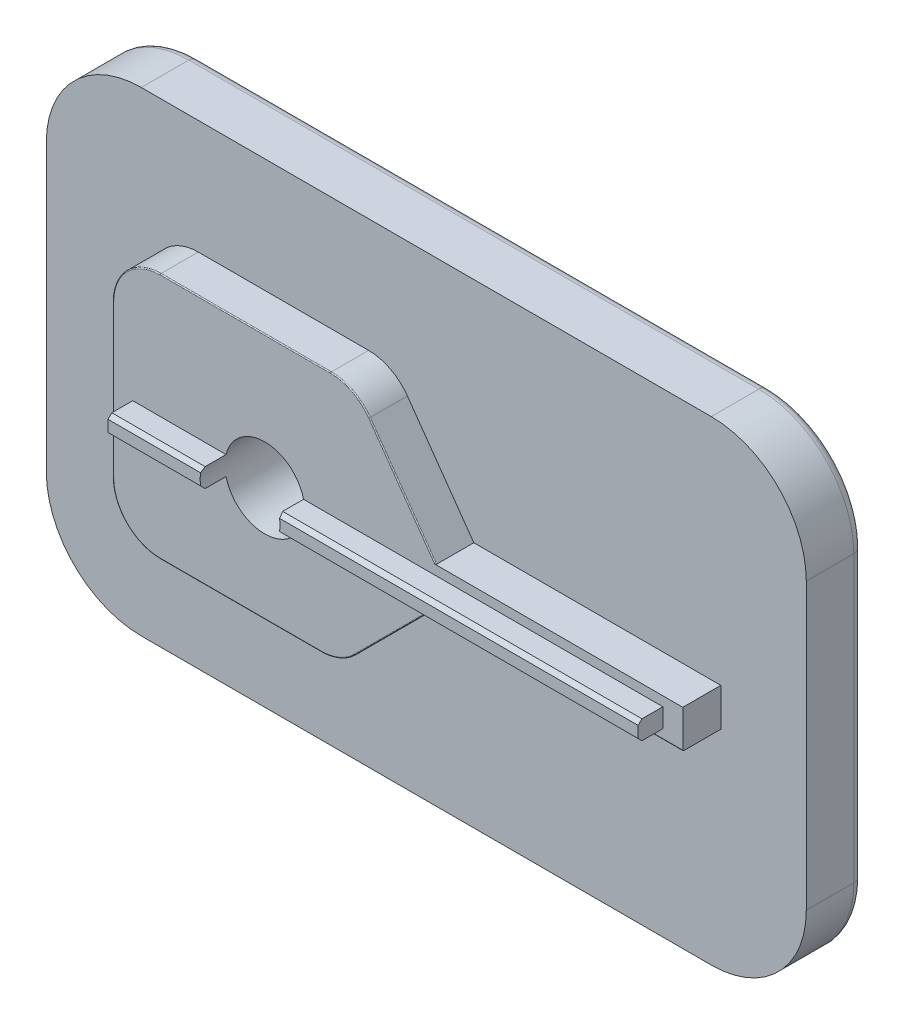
ISO-10303-21;
HEADER;
FILE_DESCRIPTION(('STEP AP214'),'2;1');
FILE_NAME('part.step','',(''),(''),'','','');
FILE_SCHEMA(('AUTOMOTIVE_DESIGN { 1 0 10303 214 1 1 1 1 }'));
ENDSEC;
DATA;
#1=APPLICATION_CONTEXT('core data for automotive mechanical design processes');
#2=APPLICATION_PROTOCOL_DEFINITION('international standard','automotive_design',2000,#1);
#3=PRODUCT_CONTEXT('',#1,'mechanical');
#4=PRODUCT('Part','Part','',(#3));
#5=PRODUCT_RELATED_PRODUCT_CATEGORY('part','',(#4));
#6=PRODUCT_DEFINITION_FORMATION('','',#4);
#7=PRODUCT_DEFINITION_CONTEXT('part definition',#1,'design');
#8=PRODUCT_DEFINITION('design','',#6,#7);
#9=PRODUCT_DEFINITION_SHAPE('','',#8);
#10=(LENGTH_UNIT() NAMED_UNIT(*) SI_UNIT(.MILLI.,.METRE.));
#11=(NAMED_UNIT(*) PLANE_ANGLE_UNIT() SI_UNIT($,.RADIAN.));
#12=(NAMED_UNIT(*) SI_UNIT($,.STERADIAN.) SOLID_ANGLE_UNIT());
#13=UNCERTAINTY_MEASURE_WITH_UNIT(LENGTH_MEASURE(1.E-05),#10,'distance_accuracy_value','');
#14=(GEOMETRIC_REPRESENTATION_CONTEXT(3) GLOBAL_UNCERTAINTY_ASSIGNED_CONTEXT((#13)) GLOBAL_UNIT_ASSIGNED_CONTEXT((#10,
#11,#12)) REPRESENTATION_CONTEXT('',''));
#15=CARTESIAN_POINT('',(0.,0.,0.));
#16=DIRECTION('',(0.,0.,1.));
#17=DIRECTION('',(1.,0.,0.));
#18=AXIS2_PLACEMENT_3D('',#15,#16,#17);
#19=CARTESIAN_POINT('',(6.55,11.5,6.3));
#20=DIRECTION('',(0.,1.,0.));
#21=DIRECTION('',(0.,0.,1.));
#22=AXIS2_PLACEMENT_3D('',#19,#20,#21);
#23=PLANE('',#22);
#24=DIRECTION('',(0.,0.,-1.));
#25=VECTOR('',#24,1.);
#26=CARTESIAN_POINT('',(34.45,11.5,6.3));
#27=LINE('',#26,#25);
#28=CARTESIAN_POINT('',(34.45,11.5,6.1));
#29=VERTEX_POINT('',#28);
#30=CARTESIAN_POINT('',(34.45,11.5,5.));
#31=VERTEX_POINT('',#30);
#32=EDGE_CURVE('E532',#29,#31,#27,.T.);
#33=ORIENTED_EDGE('',*,*,#32,.F.);
#34=DIRECTION('',(-1.,0.,0.));
#35=VECTOR('',#34,1.);
#36=CARTESIAN_POINT('',(15.5396078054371,11.5,6.1));
#37=LINE('',#36,#35);
#38=CARTESIAN_POINT('',(15.5396078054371,11.5,6.1));
#39=VERTEX_POINT('',#38);
#40=EDGE_CURVE('E490',#29,#39,#37,.T.);
#41=ORIENTED_EDGE('',*,*,#40,.T.);
#42=DIRECTION('',(0.,0.,-1.));
#43=VECTOR('',#42,1.);
#44=CARTESIAN_POINT('',(15.5396078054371,11.5,6.3));
#45=LINE('',#44,#43);
#46=CARTESIAN_POINT('',(15.5396078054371,11.5,5.));
#47=VERTEX_POINT('',#46);
#48=EDGE_CURVE('E516',#39,#47,#45,.T.);
#49=ORIENTED_EDGE('',*,*,#48,.T.);
#50=DIRECTION('',(1.,0.,0.));
#51=VECTOR('',#50,1.);
#52=CARTESIAN_POINT('',(6.55,11.5,5.));
#53=LINE('',#52,#51);
#54=EDGE_CURVE('E525',#47,#31,#53,.T.);
#55=ORIENTED_EDGE('',*,*,#54,.T.);
#56=EDGE_LOOP('',(#33,#41,#49,#55));
#57=FACE_BOUND('',#56,.T.);
#58=ADVANCED_FACE('F33',(#57),#23,.F.);
#59=CARTESIAN_POINT('',(6.55,12.5,6.3));
#60=DIRECTION('',(0.,-1.,0.));
#61=DIRECTION('',(0.,0.,-1.));
#62=AXIS2_PLACEMENT_3D('',#59,#60,#61);
#63=PLANE('',#62);
#64=DIRECTION('',(0.,0.,-1.));
#65=VECTOR('',#64,1.);
#66=CARTESIAN_POINT('',(6.55,12.5,6.3));
#67=LINE('',#66,#65);
#68=CARTESIAN_POINT('',(6.55,12.5,6.10000000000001));
#69=VERTEX_POINT('',#68);
#70=CARTESIAN_POINT('',(6.55,12.5,5.));
#71=VERTEX_POINT('',#70);
#72=EDGE_CURVE('E523',#69,#71,#67,.T.);
#73=ORIENTED_EDGE('',*,*,#72,.F.);
#74=DIRECTION('',(1.,0.,0.));
#75=VECTOR('',#74,1.);
#76=CARTESIAN_POINT('',(11.4603921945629,12.5,6.10000000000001));
#77=LINE('',#76,#75);
#78=CARTESIAN_POINT('',(11.4603921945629,12.5,6.10000000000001));
#79=VERTEX_POINT('',#78);
#80=EDGE_CURVE('E41',#69,#79,#77,.T.);
#81=ORIENTED_EDGE('',*,*,#80,.T.);
#82=DIRECTION('',(0.,0.,-1.));
#83=VECTOR('',#82,1.);
#84=CARTESIAN_POINT('',(11.4603921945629,12.5,6.3));
#85=LINE('',#84,#83);
#86=CARTESIAN_POINT('',(11.4603921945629,12.5,5.));
#87=VERTEX_POINT('',#86);
#88=EDGE_CURVE('E298',#79,#87,#85,.T.);
#89=ORIENTED_EDGE('',*,*,#88,.T.);
#90=DIRECTION('',(-1.,0.,0.));
#91=VECTOR('',#90,1.);
#92=CARTESIAN_POINT('',(6.55,12.5,5.));
#93=LINE('',#92,#91);
#94=EDGE_CURVE('E301',#87,#71,#93,.T.);
#95=ORIENTED_EDGE('',*,*,#94,.T.);
#96=EDGE_LOOP('',(#73,#81,#89,#95));
#97=FACE_BOUND('',#96,.T.);
#98=ADVANCED_FACE('F300',(#97),#63,.F.);
#99=CARTESIAN_POINT('',(0.,0.,6.3));
#100=DIRECTION('',(0.,0.,1.));
#101=DIRECTION('',(1.,0.,0.));
#102=AXIS2_PLACEMENT_3D('',#99,#100,#101);
#103=PLANE('',#102);
#104=CARTESIAN_POINT('',(13.5,12.,6.3));
#105=DIRECTION('',(0.,0.,1.));
#106=DIRECTION('',(1.,0.,0.));
#107=AXIS2_PLACEMENT_3D('',#104,#105,#106);
#108=CIRCLE('',#107,2.1);
#109=CARTESIAN_POINT('',(11.4215390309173,12.3,6.3));
#110=VERTEX_POINT('',#109);
#111=CARTESIAN_POINT('',(11.4215390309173,11.7,6.3));
#112=VERTEX_POINT('',#111);
#113=EDGE_CURVE('E467',#110,#112,#108,.T.);
#114=ORIENTED_EDGE('',*,*,#113,.F.);
#115=DIRECTION('',(-1.,0.,0.));
#116=VECTOR('',#115,1.);
#117=CARTESIAN_POINT('',(6.55,12.3,6.3));
#118=LINE('',#117,#116);
#119=CARTESIAN_POINT('',(6.55,12.3,6.3));
#120=VERTEX_POINT('',#119);
#121=EDGE_CURVE('E495',#110,#120,#118,.T.);
#122=ORIENTED_EDGE('',*,*,#121,.T.);
#123=DIRECTION('',(0.,-1.,0.));
#124=VECTOR('',#123,1.);
#125=CARTESIAN_POINT('',(6.55,12.5,6.3));
#126=LINE('',#125,#124);
#127=CARTESIAN_POINT('',(6.55,11.7,6.3));
#128=VERTEX_POINT('',#127);
#129=EDGE_CURVE('E503',#120,#128,#126,.T.);
#130=ORIENTED_EDGE('',*,*,#129,.T.);
#131=DIRECTION('',(1.,0.,0.));
#132=VECTOR('',#131,1.);
#133=CARTESIAN_POINT('',(11.4603921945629,11.7,6.3));
#134=LINE('',#133,#132);
#135=EDGE_CURVE('E492',#128,#112,#134,.T.);
#136=ORIENTED_EDGE('',*,*,#135,.T.);
#137=EDGE_LOOP('',(#114,#122,#130,#136));
#138=FACE_BOUND('',#137,.T.);
#139=ADVANCED_FACE('F508',(#138),#103,.T.);
#140=CARTESIAN_POINT('',(16.9644660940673,16.5,5.));
#141=DIRECTION('',(0.,0.,-1.));
#142=DIRECTION('',(-1.,0.,0.));
#143=AXIS2_PLACEMENT_3D('',#140,#141,#142);
#144=PLANE('',#143);
#145=DIRECTION('',(-1.,0.,0.));
#146=VECTOR('',#145,1.);
#147=CARTESIAN_POINT('',(22.5,13.,5.));
#148=LINE('',#147,#146);
#149=CARTESIAN_POINT('',(35.5,13.,5.));
#150=VERTEX_POINT('',#149);
#151=CARTESIAN_POINT('',(22.438769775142,13.,5.));
#152=VERTEX_POINT('',#151);
#153=EDGE_CURVE('E537',#150,#152,#148,.T.);
#154=ORIENTED_EDGE('',*,*,#153,.T.);
#155=DIRECTION('',(-0.577217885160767,0.81659017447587,0.));
#156=VECTOR('',#155,1.);
#157=CARTESIAN_POINT('',(18.9651120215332,17.9141838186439,5.));
#158=LINE('',#157,#156);
#159=CARTESIAN_POINT('',(18.9651120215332,17.9141838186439,5.));
#160=VERTEX_POINT('',#159);
#161=EDGE_CURVE('E412',#152,#160,#158,.T.);
#162=ORIENTED_EDGE('',*,*,#161,.T.);
#163=CARTESIAN_POINT('',(16.9644660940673,16.5,5.));
#164=DIRECTION('',(0.,0.,-1.));
#165=DIRECTION('',(-1.,0.,0.));
#166=AXIS2_PLACEMENT_3D('',#163,#164,#165);
#167=CIRCLE('',#166,2.45);
#168=CARTESIAN_POINT('',(16.9644660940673,18.95,5.));
#169=VERTEX_POINT('',#168);
#170=EDGE_CURVE('E410',#160,#169,#167,.F.);
#171=ORIENTED_EDGE('',*,*,#170,.T.);
#172=DIRECTION('',(-1.,0.,0.));
#173=VECTOR('',#172,1.);
#174=CARTESIAN_POINT('',(16.9644660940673,18.95,5.));
#175=LINE('',#174,#173);
#176=CARTESIAN_POINT('',(8.,18.95,5.));
#177=VERTEX_POINT('',#176);
#178=EDGE_CURVE('E408',#169,#177,#175,.T.);
#179=ORIENTED_EDGE('',*,*,#178,.T.);
#180=CARTESIAN_POINT('',(8.,16.5,5.));
#181=DIRECTION('',(0.,0.,-1.));
#182=DIRECTION('',(-1.,0.,0.));
#183=AXIS2_PLACEMENT_3D('',#180,#181,#182);
#184=CIRCLE('',#183,2.45);
#185=CARTESIAN_POINT('',(5.55,16.5,5.));
#186=VERTEX_POINT('',#185);
#187=EDGE_CURVE('E406',#177,#186,#184,.F.);
#188=ORIENTED_EDGE('',*,*,#187,.T.);
#189=DIRECTION('',(0.,-1.,0.));
#190=VECTOR('',#189,1.);
#191=CARTESIAN_POINT('',(5.55,16.5,5.));
#192=LINE('',#191,#190);
#193=CARTESIAN_POINT('',(5.55,8.5,5.));
#194=VERTEX_POINT('',#193);
#195=EDGE_CURVE('E404',#186,#194,#192,.T.);
#196=ORIENTED_EDGE('',*,*,#195,.T.);
#197=CARTESIAN_POINT('',(8.,8.5,5.));
#198=DIRECTION('',(0.,0.,-1.));
#199=DIRECTION('',(-1.,0.,0.));
#200=AXIS2_PLACEMENT_3D('',#197,#198,#199);
#201=CIRCLE('',#200,2.45);
#202=CARTESIAN_POINT('',(8.,6.05,5.));
#203=VERTEX_POINT('',#202);
#204=EDGE_CURVE('E402',#194,#203,#201,.F.);
#205=ORIENTED_EDGE('',*,*,#204,.T.);
#206=DIRECTION('',(1.,0.,0.));
#207=VECTOR('',#206,1.);
#208=CARTESIAN_POINT('',(16.9644660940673,6.05,5.));
#209=LINE('',#208,#207);
#210=CARTESIAN_POINT('',(16.4644660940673,6.05,5.));
#211=VERTEX_POINT('',#210);
#212=EDGE_CURVE('E400',#203,#211,#209,.T.);
#213=ORIENTED_EDGE('',*,*,#212,.T.);
#214=CARTESIAN_POINT('',(16.4644660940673,8.5,5.));
#215=DIRECTION('',(0.,0.,-1.));
#216=DIRECTION('',(-1.,0.,0.));
#217=AXIS2_PLACEMENT_3D('',#214,#215,#216);
#218=CIRCLE('',#217,2.45);
#219=CARTESIAN_POINT('',(18.1968777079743,6.76758838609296,5.));
#220=VERTEX_POINT('',#219);
#221=EDGE_CURVE('E398',#211,#220,#218,.F.);
#222=ORIENTED_EDGE('',*,*,#221,.T.);
#223=DIRECTION('',(0.707106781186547,0.707106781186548,0.));
#224=VECTOR('',#223,1.);
#225=CARTESIAN_POINT('',(22.4468777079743,11.017588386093,5.));
#226=LINE('',#225,#224);
#227=CARTESIAN_POINT('',(22.4792893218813,11.05,5.));
#228=VERTEX_POINT('',#227);
#229=EDGE_CURVE('E396',#220,#228,#226,.T.);
#230=ORIENTED_EDGE('',*,*,#229,.T.);
#231=DIRECTION('',(1.,0.,0.));
#232=VECTOR('',#231,1.);
#233=CARTESIAN_POINT('',(16.9644660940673,11.05,5.));
#234=LINE('',#233,#232);
#235=CARTESIAN_POINT('',(35.5,11.05,5.));
#236=VERTEX_POINT('',#235);
#237=EDGE_CURVE('E372',#228,#236,#234,.T.);
#238=ORIENTED_EDGE('',*,*,#237,.T.);
#239=DIRECTION('',(0.,1.,0.));
#240=VECTOR('',#239,1.);
#241=CARTESIAN_POINT('',(35.5,13.,5.));
#242=LINE('',#241,#240);
#243=EDGE_CURVE('E535',#236,#150,#242,.T.);
#244=ORIENTED_EDGE('',*,*,#243,.T.);
#245=EDGE_LOOP('',(#154,#162,#171,#179,#188,#196,#205,#213,#222,#230,#238,#244));
#246=FACE_BOUND('',#245,.T.);
#247=ORIENTED_EDGE('',*,*,#54,.F.);
#248=CARTESIAN_POINT('',(13.5,12.,5.));
#249=DIRECTION('',(0.,0.,-1.));
#250=DIRECTION('',(-1.,0.,0.));
#251=AXIS2_PLACEMENT_3D('',#248,#249,#250);
#252=CIRCLE('',#251,2.1);
#253=CARTESIAN_POINT('',(11.4603921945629,11.5,5.));
#254=VERTEX_POINT('',#253);
#255=EDGE_CURVE('E326',#254,#47,#252,.F.);
#256=ORIENTED_EDGE('',*,*,#255,.F.);
#257=CARTESIAN_POINT('',(6.55,11.5,5.));
#258=VERTEX_POINT('',#257);
#259=EDGE_CURVE('E514',#258,#254,#53,.T.);
#260=ORIENTED_EDGE('',*,*,#259,.F.);
#261=DIRECTION('',(0.,-1.,0.));
#262=VECTOR('',#261,1.);
#263=CARTESIAN_POINT('',(6.55,12.5,5.));
#264=LINE('',#263,#262);
#265=EDGE_CURVE('E318',#71,#258,#264,.T.);
#266=ORIENTED_EDGE('',*,*,#265,.F.);
#267=ORIENTED_EDGE('',*,*,#94,.F.);
#268=CARTESIAN_POINT('',(15.5396078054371,12.5,5.));
#269=VERTEX_POINT('',#268);
#270=EDGE_CURVE('E315',#269,#87,#252,.F.);
#271=ORIENTED_EDGE('',*,*,#270,.F.);
#272=CARTESIAN_POINT('',(34.45,12.5,5.));
#273=VERTEX_POINT('',#272);
#274=EDGE_CURVE('E319',#273,#269,#93,.T.);
#275=ORIENTED_EDGE('',*,*,#274,.F.);
#276=DIRECTION('',(0.,1.,0.));
#277=VECTOR('',#276,1.);
#278=CARTESIAN_POINT('',(34.45,12.5,5.));
#279=LINE('',#278,#277);
#280=EDGE_CURVE('E320',#31,#273,#279,.T.);
#281=ORIENTED_EDGE('',*,*,#280,.F.);
#282=EDGE_LOOP('',(#247,#256,#260,#266,#267,#271,#275,#281));
#283=FACE_BOUND('',#282,.T.);
#284=ADVANCED_FACE('F313',(#246,#283),#144,.F.);
#285=CARTESIAN_POINT('',(35.,20.,3.));
#286=DIRECTION('',(0.,0.,-1.));
#287=DIRECTION('',(-1.,0.,0.));
#288=AXIS2_PLACEMENT_3D('',#285,#286,#287);
#289=PLANE('',#288);
#290=CARTESIAN_POINT('',(35.,20.,3.));
#291=DIRECTION('',(0.,0.,1.));
#292=DIRECTION('',(-1.,0.,0.));
#293=AXIS2_PLACEMENT_3D('',#290,#291,#292);
#294=CIRCLE('',#293,5.);
#295=CARTESIAN_POINT('',(40.,20.,3.));
#296=VERTEX_POINT('',#295);
#297=CARTESIAN_POINT('',(35.,25.,3.));
#298=VERTEX_POINT('',#297);
#299=EDGE_CURVE('E599',#296,#298,#294,.T.);
#300=ORIENTED_EDGE('',*,*,#299,.T.);
#301=DIRECTION('',(-1.,0.,0.));
#302=VECTOR('',#301,1.);
#303=CARTESIAN_POINT('',(5.00000000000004,25.,3.));
#304=LINE('',#303,#302);
#305=CARTESIAN_POINT('',(5.00000000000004,25.,3.));
#306=VERTEX_POINT('',#305);
#307=EDGE_CURVE('E602',#298,#306,#304,.T.);
#308=ORIENTED_EDGE('',*,*,#307,.T.);
#309=CARTESIAN_POINT('',(5.,20.,3.));
#310=DIRECTION('',(0.,0.,1.));
#311=DIRECTION('',(-1.,0.,0.));
#312=AXIS2_PLACEMENT_3D('',#309,#310,#311);
#313=CIRCLE('',#312,5.);
#314=CARTESIAN_POINT('',(0.,20.,3.));
#315=VERTEX_POINT('',#314);
#316=EDGE_CURVE('E604',#306,#315,#313,.T.);
#317=ORIENTED_EDGE('',*,*,#316,.T.);
#318=DIRECTION('',(0.,-1.,0.));
#319=VECTOR('',#318,1.);
#320=CARTESIAN_POINT('',(0.,5.00000000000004,3.));
#321=LINE('',#320,#319);
#322=CARTESIAN_POINT('',(0.,5.00000000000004,3.));
#323=VERTEX_POINT('',#322);
#324=EDGE_CURVE('E606',#315,#323,#321,.T.);
#325=ORIENTED_EDGE('',*,*,#324,.T.);
#326=CARTESIAN_POINT('',(5.,5.,3.));
#327=DIRECTION('',(0.,0.,1.));
#328=DIRECTION('',(-1.,0.,0.));
#329=AXIS2_PLACEMENT_3D('',#326,#327,#328);
#330=CIRCLE('',#329,5.);
#331=CARTESIAN_POINT('',(5.00000000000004,0.,3.));
#332=VERTEX_POINT('',#331);
#333=EDGE_CURVE('E608',#323,#332,#330,.T.);
#334=ORIENTED_EDGE('',*,*,#333,.T.);
#335=DIRECTION('',(1.,0.,0.));
#336=VECTOR('',#335,1.);
#337=CARTESIAN_POINT('',(5.00000000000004,0.,3.));
#338=LINE('',#337,#336);
#339=CARTESIAN_POINT('',(35.,0.,3.));
#340=VERTEX_POINT('',#339);
#341=EDGE_CURVE('E610',#332,#340,#338,.T.);
#342=ORIENTED_EDGE('',*,*,#341,.T.);
#343=CARTESIAN_POINT('',(35.,5.,3.));
#344=DIRECTION('',(0.,0.,1.));
#345=DIRECTION('',(-1.,0.,0.));
#346=AXIS2_PLACEMENT_3D('',#343,#344,#345);
#347=CIRCLE('',#346,5.);
#348=CARTESIAN_POINT('',(40.,5.00000000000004,3.));
#349=VERTEX_POINT('',#348);
#350=EDGE_CURVE('E612',#340,#349,#347,.T.);
#351=ORIENTED_EDGE('',*,*,#350,.T.);
#352=DIRECTION('',(0.,1.,0.));
#353=VECTOR('',#352,1.);
#354=CARTESIAN_POINT('',(40.,5.00000000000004,3.));
#355=LINE('',#354,#353);
#356=EDGE_CURVE('E614',#349,#296,#355,.T.);
#357=ORIENTED_EDGE('',*,*,#356,.T.);
#358=EDGE_LOOP('',(#300,#308,#317,#325,#334,#342,#351,#357));
#359=FACE_BOUND('',#358,.T.);
#360=CARTESIAN_POINT('',(16.9644660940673,16.5,3.));
#361=DIRECTION('',(0.,0.,1.));
#362=DIRECTION('',(-1.,0.,0.));
#363=AXIS2_PLACEMENT_3D('',#360,#361,#362);
#364=CIRCLE('',#363,2.5);
#365=CARTESIAN_POINT('',(19.005941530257,17.9430447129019,3.));
#366=VERTEX_POINT('',#365);
#367=CARTESIAN_POINT('',(16.9644660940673,19.,3.));
#368=VERTEX_POINT('',#367);
#369=EDGE_CURVE('E330',#366,#368,#364,.T.);
#370=ORIENTED_EDGE('',*,*,#369,.F.);
#371=DIRECTION('',(-0.577217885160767,0.81659017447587,0.));
#372=VECTOR('',#371,1.);
#373=CARTESIAN_POINT('',(19.005941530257,17.9430447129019,3.));
#374=LINE('',#373,#372);
#375=CARTESIAN_POINT('',(22.5,13.,3.));
#376=VERTEX_POINT('',#375);
#377=EDGE_CURVE('E538',#376,#366,#374,.T.);
#378=ORIENTED_EDGE('',*,*,#377,.F.);
#379=DIRECTION('',(-1.,0.,0.));
#380=VECTOR('',#379,1.);
#381=CARTESIAN_POINT('',(22.5,13.,3.));
#382=LINE('',#381,#380);
#383=CARTESIAN_POINT('',(35.5,13.,3.));
#384=VERTEX_POINT('',#383);
#385=EDGE_CURVE('E570',#384,#376,#382,.T.);
#386=ORIENTED_EDGE('',*,*,#385,.F.);
#387=DIRECTION('',(0.,1.,0.));
#388=VECTOR('',#387,1.);
#389=CARTESIAN_POINT('',(35.5,13.,3.));
#390=LINE('',#389,#388);
#391=CARTESIAN_POINT('',(35.5,11.,3.));
#392=VERTEX_POINT('',#391);
#393=EDGE_CURVE('E567',#392,#384,#390,.T.);
#394=ORIENTED_EDGE('',*,*,#393,.F.);
#395=DIRECTION('',(1.,0.,0.));
#396=VECTOR('',#395,1.);
#397=CARTESIAN_POINT('',(22.5,11.,3.));
#398=LINE('',#397,#396);
#399=CARTESIAN_POINT('',(22.5,11.,3.));
#400=VERTEX_POINT('',#399);
#401=EDGE_CURVE('E564',#400,#392,#398,.T.);
#402=ORIENTED_EDGE('',*,*,#401,.F.);
#403=DIRECTION('',(0.707106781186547,0.707106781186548,0.));
#404=VECTOR('',#403,1.);
#405=CARTESIAN_POINT('',(18.2322330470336,6.73223304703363,3.));
#406=LINE('',#405,#404);
#407=CARTESIAN_POINT('',(18.2322330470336,6.73223304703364,3.));
#408=VERTEX_POINT('',#407);
#409=EDGE_CURVE('E561',#408,#400,#406,.T.);
#410=ORIENTED_EDGE('',*,*,#409,.F.);
#411=CARTESIAN_POINT('',(16.4644660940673,8.5,3.));
#412=DIRECTION('',(0.,0.,1.));
#413=DIRECTION('',(-1.,0.,0.));
#414=AXIS2_PLACEMENT_3D('',#411,#412,#413);
#415=CIRCLE('',#414,2.5);
#416=CARTESIAN_POINT('',(16.4644660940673,6.,3.));
#417=VERTEX_POINT('',#416);
#418=EDGE_CURVE('E558',#417,#408,#415,.T.);
#419=ORIENTED_EDGE('',*,*,#418,.F.);
#420=DIRECTION('',(1.,0.,0.));
#421=VECTOR('',#420,1.);
#422=CARTESIAN_POINT('',(8.,6.,3.));
#423=LINE('',#422,#421);
#424=CARTESIAN_POINT('',(8.,6.,3.));
#425=VERTEX_POINT('',#424);
#426=EDGE_CURVE('E555',#425,#417,#423,.T.);
#427=ORIENTED_EDGE('',*,*,#426,.F.);
#428=CARTESIAN_POINT('',(8.,8.5,3.));
#429=DIRECTION('',(0.,0.,1.));
#430=DIRECTION('',(-1.,0.,0.));
#431=AXIS2_PLACEMENT_3D('',#428,#429,#430);
#432=CIRCLE('',#431,2.5);
#433=CARTESIAN_POINT('',(5.5,8.5,3.));
#434=VERTEX_POINT('',#433);
#435=EDGE_CURVE('E552',#434,#425,#432,.T.);
#436=ORIENTED_EDGE('',*,*,#435,.F.);
#437=DIRECTION('',(0.,-1.,0.));
#438=VECTOR('',#437,1.);
#439=CARTESIAN_POINT('',(5.5,16.5,3.));
#440=LINE('',#439,#438);
#441=CARTESIAN_POINT('',(5.5,16.5,3.));
#442=VERTEX_POINT('',#441);
#443=EDGE_CURVE('E549',#442,#434,#440,.T.);
#444=ORIENTED_EDGE('',*,*,#443,.F.);
#445=CARTESIAN_POINT('',(8.,16.5,3.));
#446=DIRECTION('',(0.,0.,1.));
#447=DIRECTION('',(-1.,0.,0.));
#448=AXIS2_PLACEMENT_3D('',#445,#446,#447);
#449=CIRCLE('',#448,2.5);
#450=CARTESIAN_POINT('',(8.,19.,3.));
#451=VERTEX_POINT('',#450);
#452=EDGE_CURVE('E546',#451,#442,#449,.T.);
#453=ORIENTED_EDGE('',*,*,#452,.F.);
#454=DIRECTION('',(-1.,0.,0.));
#455=VECTOR('',#454,1.);
#456=CARTESIAN_POINT('',(8.,19.,3.));
#457=LINE('',#456,#455);
#458=EDGE_CURVE('E543',#368,#451,#457,.T.);
#459=ORIENTED_EDGE('',*,*,#458,.F.);
#460=EDGE_LOOP('',(#370,#378,#386,#394,#402,#410,#419,#427,#436,#444,#453,#459));
#461=FACE_BOUND('',#460,.T.);
#462=ADVANCED_FACE('F669',(#359,#461),#289,.F.);
#463=CARTESIAN_POINT('',(35.,20.,3.));
#464=DIRECTION('',(0.,0.,-1.));
#465=DIRECTION('',(-1.,0.,0.));
#466=AXIS2_PLACEMENT_3D('',#463,#464,#465);
#467=CYLINDRICAL_SURFACE('',#466,5.);
#468=DIRECTION('',(0.,0.,-1.));
#469=VECTOR('',#468,1.);
#470=CARTESIAN_POINT('',(40.,20.,3.));
#471=LINE('',#470,#469);
#472=CARTESIAN_POINT('',(40.,20.,0.5));
#473=VERTEX_POINT('',#472);
#474=EDGE_CURVE('E616',#296,#473,#471,.T.);
#475=ORIENTED_EDGE('',*,*,#474,.T.);
#476=CARTESIAN_POINT('',(35.,20.,0.5));
#477=DIRECTION('',(0.,0.,-1.));
#478=DIRECTION('',(-1.,0.,0.));
#479=AXIS2_PLACEMENT_3D('',#476,#477,#478);
#480=CIRCLE('',#479,5.);
#481=CARTESIAN_POINT('',(35.,25.,0.5));
#482=VERTEX_POINT('',#481);
#483=EDGE_CURVE('E364',#473,#482,#480,.F.);
#484=ORIENTED_EDGE('',*,*,#483,.T.);
#485=DIRECTION('',(0.,0.,-1.));
#486=VECTOR('',#485,1.);
#487=CARTESIAN_POINT('',(35.,25.,3.));
#488=LINE('',#487,#486);
#489=EDGE_CURVE('E336',#298,#482,#488,.T.);
#490=ORIENTED_EDGE('',*,*,#489,.F.);
#491=ORIENTED_EDGE('',*,*,#299,.F.);
#492=EDGE_LOOP('',(#475,#484,#490,#491));
#493=FACE_BOUND('',#492,.T.);
#494=ADVANCED_FACE('F674',(#493),#467,.T.);
#495=CARTESIAN_POINT('',(5.00000000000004,25.,3.));
#496=DIRECTION('',(0.,-1.,0.));
#497=DIRECTION('',(0.,0.,-1.));
#498=AXIS2_PLACEMENT_3D('',#495,#496,#497);
#499=PLANE('',#498);
#500=ORIENTED_EDGE('',*,*,#489,.T.);
#501=DIRECTION('',(-1.,0.,0.));
#502=VECTOR('',#501,1.);
#503=CARTESIAN_POINT('',(5.00000000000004,25.,0.5));
#504=LINE('',#503,#502);
#505=CARTESIAN_POINT('',(5.00000000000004,25.,0.5));
#506=VERTEX_POINT('',#505);
#507=EDGE_CURVE('E362',#482,#506,#504,.T.);
#508=ORIENTED_EDGE('',*,*,#507,.T.);
#509=DIRECTION('',(0.,0.,-1.));
#510=VECTOR('',#509,1.);
#511=CARTESIAN_POINT('',(5.00000000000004,25.,3.));
#512=LINE('',#511,#510);
#513=EDGE_CURVE('E633',#306,#506,#512,.T.);
#514=ORIENTED_EDGE('',*,*,#513,.F.);
#515=ORIENTED_EDGE('',*,*,#307,.F.);
#516=EDGE_LOOP('',(#500,#508,#514,#515));
#517=FACE_BOUND('',#516,.T.);
#518=ADVANCED_FACE('F643',(#517),#499,.F.);
#519=CARTESIAN_POINT('',(5.,20.,3.));
#520=DIRECTION('',(0.,0.,-1.));
#521=DIRECTION('',(-1.,0.,0.));
#522=AXIS2_PLACEMENT_3D('',#519,#520,#521);
#523=CYLINDRICAL_SURFACE('',#522,5.);
#524=ORIENTED_EDGE('',*,*,#513,.T.);
#525=CARTESIAN_POINT('',(5.,20.,0.5));
#526=DIRECTION('',(0.,0.,-1.));
#527=DIRECTION('',(-1.,0.,0.));
#528=AXIS2_PLACEMENT_3D('',#525,#526,#527);
#529=CIRCLE('',#528,5.);
#530=CARTESIAN_POINT('',(0.,20.,0.5));
#531=VERTEX_POINT('',#530);
#532=EDGE_CURVE('E360',#506,#531,#529,.F.);
#533=ORIENTED_EDGE('',*,*,#532,.T.);
#534=DIRECTION('',(0.,0.,-1.));
#535=VECTOR('',#534,1.);
#536=CARTESIAN_POINT('',(0.,20.,3.));
#537=LINE('',#536,#535);
#538=EDGE_CURVE('E631',#315,#531,#537,.T.);
#539=ORIENTED_EDGE('',*,*,#538,.F.);
#540=ORIENTED_EDGE('',*,*,#316,.F.);
#541=EDGE_LOOP('',(#524,#533,#539,#540));
#542=FACE_BOUND('',#541,.T.);
#543=ADVANCED_FACE('F662',(#542),#523,.T.);
#544=CARTESIAN_POINT('',(0.,5.00000000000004,3.));
#545=DIRECTION('',(1.,0.,0.));
#546=DIRECTION('',(0.,0.,-1.));
#547=AXIS2_PLACEMENT_3D('',#544,#545,#546);
#548=PLANE('',#547);
#549=ORIENTED_EDGE('',*,*,#538,.T.);
#550=DIRECTION('',(0.,-1.,0.));
#551=VECTOR('',#550,1.);
#552=CARTESIAN_POINT('',(0.,5.00000000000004,0.5));
#553=LINE('',#552,#551);
#554=CARTESIAN_POINT('',(0.,5.00000000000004,0.5));
#555=VERTEX_POINT('',#554);
#556=EDGE_CURVE('E358',#531,#555,#553,.T.);
#557=ORIENTED_EDGE('',*,*,#556,.T.);
#558=DIRECTION('',(0.,0.,-1.));
#559=VECTOR('',#558,1.);
#560=CARTESIAN_POINT('',(0.,5.00000000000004,3.));
#561=LINE('',#560,#559);
#562=EDGE_CURVE('E628',#323,#555,#561,.T.);
#563=ORIENTED_EDGE('',*,*,#562,.F.);
#564=ORIENTED_EDGE('',*,*,#324,.F.);
#565=EDGE_LOOP('',(#549,#557,#563,#564));
#566=FACE_BOUND('',#565,.T.);
#567=ADVANCED_FACE('F665',(#566),#548,.F.);
#568=CARTESIAN_POINT('',(5.,5.,3.));
#569=DIRECTION('',(0.,0.,-1.));
#570=DIRECTION('',(-1.,0.,0.));
#571=AXIS2_PLACEMENT_3D('',#568,#569,#570);
#572=CYLINDRICAL_SURFACE('',#571,5.);
#573=ORIENTED_EDGE('',*,*,#562,.T.);
#574=CARTESIAN_POINT('',(5.,5.,0.5));
#575=DIRECTION('',(0.,0.,-1.));
#576=DIRECTION('',(-1.,0.,0.));
#577=AXIS2_PLACEMENT_3D('',#574,#575,#576);
#578=CIRCLE('',#577,5.);
#579=CARTESIAN_POINT('',(5.00000000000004,0.,0.5));
#580=VERTEX_POINT('',#579);
#581=EDGE_CURVE('E338',#555,#580,#578,.F.);
#582=ORIENTED_EDGE('',*,*,#581,.T.);
#583=DIRECTION('',(0.,0.,-1.));
#584=VECTOR('',#583,1.);
#585=CARTESIAN_POINT('',(5.00000000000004,0.,3.));
#586=LINE('',#585,#584);
#587=EDGE_CURVE('E625',#332,#580,#586,.T.);
#588=ORIENTED_EDGE('',*,*,#587,.F.);
#589=ORIENTED_EDGE('',*,*,#333,.F.);
#590=EDGE_LOOP('',(#573,#582,#588,#589));
#591=FACE_BOUND('',#590,.T.);
#592=ADVANCED_FACE('F703',(#591),#572,.T.);
#593=CARTESIAN_POINT('',(5.00000000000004,0.,3.));
#594=DIRECTION('',(0.,1.,0.));
#595=DIRECTION('',(0.,0.,1.));
#596=AXIS2_PLACEMENT_3D('',#593,#594,#595);
#597=PLANE('',#596);
#598=ORIENTED_EDGE('',*,*,#587,.T.);
#599=DIRECTION('',(1.,0.,0.));
#600=VECTOR('',#599,1.);
#601=CARTESIAN_POINT('',(35.,0.,0.5));
#602=LINE('',#601,#600);
#603=CARTESIAN_POINT('',(35.,0.,0.5));
#604=VERTEX_POINT('',#603);
#605=EDGE_CURVE('E370',#580,#604,#602,.T.);
#606=ORIENTED_EDGE('',*,*,#605,.T.);
#607=DIRECTION('',(0.,0.,-1.));
#608=VECTOR('',#607,1.);
#609=CARTESIAN_POINT('',(35.,0.,3.));
#610=LINE('',#609,#608);
#611=EDGE_CURVE('E622',#340,#604,#610,.T.);
#612=ORIENTED_EDGE('',*,*,#611,.F.);
#613=ORIENTED_EDGE('',*,*,#341,.F.);
#614=EDGE_LOOP('',(#598,#606,#612,#613));
#615=FACE_BOUND('',#614,.T.);
#616=ADVANCED_FACE('F706',(#615),#597,.F.);
#617=CARTESIAN_POINT('',(35.,5.,3.));
#618=DIRECTION('',(0.,0.,-1.));
#619=DIRECTION('',(-1.,0.,0.));
#620=AXIS2_PLACEMENT_3D('',#617,#618,#619);
#621=CYLINDRICAL_SURFACE('',#620,5.);
#622=ORIENTED_EDGE('',*,*,#611,.T.);
#623=CARTESIAN_POINT('',(35.,5.,0.5));
#624=DIRECTION('',(0.,0.,-1.));
#625=DIRECTION('',(-1.,0.,0.));
#626=AXIS2_PLACEMENT_3D('',#623,#624,#625);
#627=CIRCLE('',#626,5.);
#628=CARTESIAN_POINT('',(40.,5.00000000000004,0.5));
#629=VERTEX_POINT('',#628);
#630=EDGE_CURVE('E368',#604,#629,#627,.F.);
#631=ORIENTED_EDGE('',*,*,#630,.T.);
#632=DIRECTION('',(0.,0.,-1.));
#633=VECTOR('',#632,1.);
#634=CARTESIAN_POINT('',(40.,5.00000000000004,3.));
#635=LINE('',#634,#633);
#636=EDGE_CURVE('E619',#349,#629,#635,.T.);
#637=ORIENTED_EDGE('',*,*,#636,.F.);
#638=ORIENTED_EDGE('',*,*,#350,.F.);
#639=EDGE_LOOP('',(#622,#631,#637,#638));
#640=FACE_BOUND('',#639,.T.);
#641=ADVANCED_FACE('F710',(#640),#621,.T.);
#642=CARTESIAN_POINT('',(40.,5.00000000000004,3.));
#643=DIRECTION('',(-1.,0.,0.));
#644=DIRECTION('',(0.,0.,1.));
#645=AXIS2_PLACEMENT_3D('',#642,#643,#644);
#646=PLANE('',#645);
#647=ORIENTED_EDGE('',*,*,#636,.T.);
#648=DIRECTION('',(0.,1.,0.));
#649=VECTOR('',#648,1.);
#650=CARTESIAN_POINT('',(40.,20.,0.5));
#651=LINE('',#650,#649);
#652=EDGE_CURVE('E366',#629,#473,#651,.T.);
#653=ORIENTED_EDGE('',*,*,#652,.T.);
#654=ORIENTED_EDGE('',*,*,#474,.F.);
#655=ORIENTED_EDGE('',*,*,#356,.F.);
#656=EDGE_LOOP('',(#647,#653,#654,#655));
#657=FACE_BOUND('',#656,.T.);
#658=ADVANCED_FACE('F676',(#657),#646,.F.);
#659=CARTESIAN_POINT('',(35.,20.,0.));
#660=DIRECTION('',(0.,0.,-1.));
#661=DIRECTION('',(-1.,0.,0.));
#662=AXIS2_PLACEMENT_3D('',#659,#660,#661);
#663=PLANE('',#662);
#664=DIRECTION('',(1.,0.,0.));
#665=VECTOR('',#664,1.);
#666=CARTESIAN_POINT('',(5.00000000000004,0.5,0.));
#667=LINE('',#666,#665);
#668=CARTESIAN_POINT('',(35.,0.5,0.));
#669=VERTEX_POINT('',#668);
#670=CARTESIAN_POINT('',(5.00000000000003,0.5,0.));
#671=VERTEX_POINT('',#670);
#672=EDGE_CURVE('E341',#669,#671,#667,.F.);
#673=ORIENTED_EDGE('',*,*,#672,.T.);
#674=CARTESIAN_POINT('',(5.,5.,0.));
#675=DIRECTION('',(0.,0.,-1.));
#676=DIRECTION('',(-1.,0.,0.));
#677=AXIS2_PLACEMENT_3D('',#674,#675,#676);
#678=CIRCLE('',#677,4.5);
#679=CARTESIAN_POINT('',(0.5,5.00000000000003,0.));
#680=VERTEX_POINT('',#679);
#681=EDGE_CURVE('E355',#671,#680,#678,.T.);
#682=ORIENTED_EDGE('',*,*,#681,.T.);
#683=DIRECTION('',(0.,-1.,0.));
#684=VECTOR('',#683,1.);
#685=CARTESIAN_POINT('',(0.5,20.,0.));
#686=LINE('',#685,#684);
#687=CARTESIAN_POINT('',(0.5,20.,0.));
#688=VERTEX_POINT('',#687);
#689=EDGE_CURVE('E353',#680,#688,#686,.F.);
#690=ORIENTED_EDGE('',*,*,#689,.T.);
#691=CARTESIAN_POINT('',(5.,20.,0.));
#692=DIRECTION('',(0.,0.,-1.));
#693=DIRECTION('',(-1.,0.,0.));
#694=AXIS2_PLACEMENT_3D('',#691,#692,#693);
#695=CIRCLE('',#694,4.5);
#696=CARTESIAN_POINT('',(5.00000000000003,24.5,0.));
#697=VERTEX_POINT('',#696);
#698=EDGE_CURVE('E351',#688,#697,#695,.T.);
#699=ORIENTED_EDGE('',*,*,#698,.T.);
#700=DIRECTION('',(-1.,0.,0.));
#701=VECTOR('',#700,1.);
#702=CARTESIAN_POINT('',(35.,24.5,0.));
#703=LINE('',#702,#701);
#704=CARTESIAN_POINT('',(35.,24.5,0.));
#705=VERTEX_POINT('',#704);
#706=EDGE_CURVE('E349',#697,#705,#703,.F.);
#707=ORIENTED_EDGE('',*,*,#706,.T.);
#708=CARTESIAN_POINT('',(35.,20.,0.));
#709=DIRECTION('',(0.,0.,-1.));
#710=DIRECTION('',(-1.,0.,0.));
#711=AXIS2_PLACEMENT_3D('',#708,#709,#710);
#712=CIRCLE('',#711,4.5);
#713=CARTESIAN_POINT('',(39.5,20.,0.));
#714=VERTEX_POINT('',#713);
#715=EDGE_CURVE('E347',#705,#714,#712,.T.);
#716=ORIENTED_EDGE('',*,*,#715,.T.);
#717=DIRECTION('',(0.,1.,0.));
#718=VECTOR('',#717,1.);
#719=CARTESIAN_POINT('',(39.5,5.00000000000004,0.));
#720=LINE('',#719,#718);
#721=CARTESIAN_POINT('',(39.5,5.00000000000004,0.));
#722=VERTEX_POINT('',#721);
#723=EDGE_CURVE('E345',#714,#722,#720,.F.);
#724=ORIENTED_EDGE('',*,*,#723,.T.);
#725=CARTESIAN_POINT('',(35.,5.,0.));
#726=DIRECTION('',(0.,0.,-1.));
#727=DIRECTION('',(-1.,0.,0.));
#728=AXIS2_PLACEMENT_3D('',#725,#726,#727);
#729=CIRCLE('',#728,4.5);
#730=EDGE_CURVE('E343',#722,#669,#729,.T.);
#731=ORIENTED_EDGE('',*,*,#730,.T.);
#732=EDGE_LOOP('',(#673,#682,#690,#699,#707,#716,#724,#731));
#733=FACE_BOUND('',#732,.T.);
#734=CARTESIAN_POINT('',(13.5,12.,0.));
#735=DIRECTION('',(0.,0.,1.));
#736=DIRECTION('',(1.,0.,0.));
#737=AXIS2_PLACEMENT_3D('',#734,#735,#736);
#738=CIRCLE('',#737,2.1);
#739=CARTESIAN_POINT('',(15.6,12.,0.));
#740=VERTEX_POINT('',#739);
#741=EDGE_CURVE('E327',#740,#740,#738,.T.);
#742=ORIENTED_EDGE('',*,*,#741,.T.);
#743=EDGE_LOOP('',(#742));
#744=FACE_BOUND('',#743,.T.);
#745=ADVANCED_FACE('F690',(#733,#744),#663,.T.);
#746=CARTESIAN_POINT('',(16.9644660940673,16.5,5.));
#747=DIRECTION('',(0.,0.,-1.));
#748=DIRECTION('',(-1.,0.,0.));
#749=AXIS2_PLACEMENT_3D('',#746,#747,#748);
#750=CYLINDRICAL_SURFACE('',#749,2.5);
#751=DIRECTION('',(0.,0.,-1.));
#752=VECTOR('',#751,1.);
#753=CARTESIAN_POINT('',(16.9644660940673,19.,5.));
#754=LINE('',#753,#752);
#755=CARTESIAN_POINT('',(16.9644660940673,19.,4.95));
#756=VERTEX_POINT('',#755);
#757=EDGE_CURVE('E597',#756,#368,#754,.T.);
#758=ORIENTED_EDGE('',*,*,#757,.F.);
#759=CARTESIAN_POINT('',(16.9644660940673,16.5,4.95));
#760=DIRECTION('',(0.,0.,-1.));
#761=DIRECTION('',(-1.,0.,0.));
#762=AXIS2_PLACEMENT_3D('',#759,#760,#761);
#763=CIRCLE('',#762,2.5);
#764=CARTESIAN_POINT('',(19.005941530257,17.9430447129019,4.95));
#765=VERTEX_POINT('',#764);
#766=EDGE_CURVE('E417',#756,#765,#763,.T.);
#767=ORIENTED_EDGE('',*,*,#766,.T.);
#768=DIRECTION('',(0.,0.,-1.));
#769=VECTOR('',#768,1.);
#770=CARTESIAN_POINT('',(19.005941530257,17.9430447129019,5.));
#771=LINE('',#770,#769);
#772=EDGE_CURVE('E540',#765,#366,#771,.T.);
#773=ORIENTED_EDGE('',*,*,#772,.T.);
#774=ORIENTED_EDGE('',*,*,#369,.T.);
#775=EDGE_LOOP('',(#758,#767,#773,#774));
#776=FACE_BOUND('',#775,.T.);
#777=ADVANCED_FACE('F794',(#776),#750,.T.);
#778=CARTESIAN_POINT('',(8.,19.,5.));
#779=DIRECTION('',(0.,-1.,0.));
#780=DIRECTION('',(1.,0.,0.));
#781=AXIS2_PLACEMENT_3D('',#778,#779,#780);
#782=PLANE('',#781);
#783=DIRECTION('',(0.,0.,-1.));
#784=VECTOR('',#783,1.);
#785=CARTESIAN_POINT('',(8.,19.,5.));
#786=LINE('',#785,#784);
#787=CARTESIAN_POINT('',(8.,19.,4.95));
#788=VERTEX_POINT('',#787);
#789=EDGE_CURVE('E595',#788,#451,#786,.T.);
#790=ORIENTED_EDGE('',*,*,#789,.F.);
#791=DIRECTION('',(-1.,0.,0.));
#792=VECTOR('',#791,1.);
#793=CARTESIAN_POINT('',(8.,19.,4.95));
#794=LINE('',#793,#792);
#795=EDGE_CURVE('E419',#788,#756,#794,.F.);
#796=ORIENTED_EDGE('',*,*,#795,.T.);
#797=ORIENTED_EDGE('',*,*,#757,.T.);
#798=ORIENTED_EDGE('',*,*,#458,.T.);
#799=EDGE_LOOP('',(#790,#796,#797,#798));
#800=FACE_BOUND('',#799,.T.);
#801=ADVANCED_FACE('F790',(#800),#782,.F.);
#802=CARTESIAN_POINT('',(8.,16.5,5.));
#803=DIRECTION('',(0.,0.,-1.));
#804=DIRECTION('',(-1.,0.,0.));
#805=AXIS2_PLACEMENT_3D('',#802,#803,#804);
#806=CYLINDRICAL_SURFACE('',#805,2.5);
#807=DIRECTION('',(0.,0.,-1.));
#808=VECTOR('',#807,1.);
#809=CARTESIAN_POINT('',(5.5,16.5,5.));
#810=LINE('',#809,#808);
#811=CARTESIAN_POINT('',(5.5,16.5,4.95));
#812=VERTEX_POINT('',#811);
#813=EDGE_CURVE('E593',#812,#442,#810,.T.);
#814=ORIENTED_EDGE('',*,*,#813,.F.);
#815=CARTESIAN_POINT('',(8.,16.5,4.95));
#816=DIRECTION('',(0.,0.,-1.));
#817=DIRECTION('',(-1.,0.,0.));
#818=AXIS2_PLACEMENT_3D('',#815,#816,#817);
#819=CIRCLE('',#818,2.5);
#820=EDGE_CURVE('E421',#812,#788,#819,.T.);
#821=ORIENTED_EDGE('',*,*,#820,.T.);
#822=ORIENTED_EDGE('',*,*,#789,.T.);
#823=ORIENTED_EDGE('',*,*,#452,.T.);
#824=EDGE_LOOP('',(#814,#821,#822,#823));
#825=FACE_BOUND('',#824,.T.);
#826=ADVANCED_FACE('F786',(#825),#806,.T.);
#827=CARTESIAN_POINT('',(5.5,16.5,5.));
#828=DIRECTION('',(1.,0.,0.));
#829=DIRECTION('',(0.,0.,-1.));
#830=AXIS2_PLACEMENT_3D('',#827,#828,#829);
#831=PLANE('',#830);
#832=DIRECTION('',(0.,0.,-1.));
#833=VECTOR('',#832,1.);
#834=CARTESIAN_POINT('',(5.5,8.5,5.));
#835=LINE('',#834,#833);
#836=CARTESIAN_POINT('',(5.5,8.5,4.95));
#837=VERTEX_POINT('',#836);
#838=EDGE_CURVE('E591',#837,#434,#835,.T.);
#839=ORIENTED_EDGE('',*,*,#838,.F.);
#840=DIRECTION('',(0.,-1.,0.));
#841=VECTOR('',#840,1.);
#842=CARTESIAN_POINT('',(5.5,16.5,4.95));
#843=LINE('',#842,#841);
#844=EDGE_CURVE('E423',#837,#812,#843,.F.);
#845=ORIENTED_EDGE('',*,*,#844,.T.);
#846=ORIENTED_EDGE('',*,*,#813,.T.);
#847=ORIENTED_EDGE('',*,*,#443,.T.);
#848=EDGE_LOOP('',(#839,#845,#846,#847));
#849=FACE_BOUND('',#848,.T.);
#850=ADVANCED_FACE('F782',(#849),#831,.F.);
#851=CARTESIAN_POINT('',(8.,8.5,5.));
#852=DIRECTION('',(0.,0.,-1.));
#853=DIRECTION('',(-1.,0.,0.));
#854=AXIS2_PLACEMENT_3D('',#851,#852,#853);
#855=CYLINDRICAL_SURFACE('',#854,2.5);
#856=DIRECTION('',(0.,0.,-1.));
#857=VECTOR('',#856,1.);
#858=CARTESIAN_POINT('',(8.,6.,5.));
#859=LINE('',#858,#857);
#860=CARTESIAN_POINT('',(8.,6.,4.95));
#861=VERTEX_POINT('',#860);
#862=EDGE_CURVE('E589',#861,#425,#859,.T.);
#863=ORIENTED_EDGE('',*,*,#862,.F.);
#864=CARTESIAN_POINT('',(8.,8.5,4.95));
#865=DIRECTION('',(0.,0.,-1.));
#866=DIRECTION('',(-1.,0.,0.));
#867=AXIS2_PLACEMENT_3D('',#864,#865,#866);
#868=CIRCLE('',#867,2.5);
#869=EDGE_CURVE('E425',#861,#837,#868,.T.);
#870=ORIENTED_EDGE('',*,*,#869,.T.);
#871=ORIENTED_EDGE('',*,*,#838,.T.);
#872=ORIENTED_EDGE('',*,*,#435,.T.);
#873=EDGE_LOOP('',(#863,#870,#871,#872));
#874=FACE_BOUND('',#873,.T.);
#875=ADVANCED_FACE('F778',(#874),#855,.T.);
#876=CARTESIAN_POINT('',(8.,6.,5.));
#877=DIRECTION('',(0.,1.,0.));
#878=DIRECTION('',(0.,0.,1.));
#879=AXIS2_PLACEMENT_3D('',#876,#877,#878);
#880=PLANE('',#879);
#881=DIRECTION('',(0.,0.,-1.));
#882=VECTOR('',#881,1.);
#883=CARTESIAN_POINT('',(16.4644660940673,6.,5.));
#884=LINE('',#883,#882);
#885=CARTESIAN_POINT('',(16.4644660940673,6.,4.95));
#886=VERTEX_POINT('',#885);
#887=EDGE_CURVE('E587',#886,#417,#884,.T.);
#888=ORIENTED_EDGE('',*,*,#887,.F.);
#889=DIRECTION('',(1.,0.,0.));
#890=VECTOR('',#889,1.);
#891=CARTESIAN_POINT('',(8.,6.,4.95));
#892=LINE('',#891,#890);
#893=EDGE_CURVE('E427',#886,#861,#892,.F.);
#894=ORIENTED_EDGE('',*,*,#893,.T.);
#895=ORIENTED_EDGE('',*,*,#862,.T.);
#896=ORIENTED_EDGE('',*,*,#426,.T.);
#897=EDGE_LOOP('',(#888,#894,#895,#896));
#898=FACE_BOUND('',#897,.T.);
#899=ADVANCED_FACE('F774',(#898),#880,.F.);
#900=CARTESIAN_POINT('',(16.4644660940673,8.5,5.));
#901=DIRECTION('',(0.,0.,-1.));
#902=DIRECTION('',(-1.,0.,0.));
#903=AXIS2_PLACEMENT_3D('',#900,#901,#902);
#904=CYLINDRICAL_SURFACE('',#903,2.5);
#905=DIRECTION('',(0.,0.,-1.));
#906=VECTOR('',#905,1.);
#907=CARTESIAN_POINT('',(18.2322330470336,6.73223304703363,5.));
#908=LINE('',#907,#906);
#909=CARTESIAN_POINT('',(18.2322330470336,6.73223304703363,4.95));
#910=VERTEX_POINT('',#909);
#911=EDGE_CURVE('E585',#910,#408,#908,.T.);
#912=ORIENTED_EDGE('',*,*,#911,.F.);
#913=CARTESIAN_POINT('',(16.4644660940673,8.5,4.95));
#914=DIRECTION('',(0.,0.,-1.));
#915=DIRECTION('',(-1.,0.,0.));
#916=AXIS2_PLACEMENT_3D('',#913,#914,#915);
#917=CIRCLE('',#916,2.5);
#918=EDGE_CURVE('E429',#910,#886,#917,.T.);
#919=ORIENTED_EDGE('',*,*,#918,.T.);
#920=ORIENTED_EDGE('',*,*,#887,.T.);
#921=ORIENTED_EDGE('',*,*,#418,.T.);
#922=EDGE_LOOP('',(#912,#919,#920,#921));
#923=FACE_BOUND('',#922,.T.);
#924=ADVANCED_FACE('F770',(#923),#904,.T.);
#925=CARTESIAN_POINT('',(18.2322330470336,6.73223304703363,5.));
#926=DIRECTION('',(-0.707106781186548,0.707106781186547,0.));
#927=DIRECTION('',(-0.707106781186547,-0.707106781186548,0.));
#928=AXIS2_PLACEMENT_3D('',#925,#926,#927);
#929=PLANE('',#928);
#930=DIRECTION('',(0.,0.,-1.));
#931=VECTOR('',#930,1.);
#932=CARTESIAN_POINT('',(22.5,11.,5.));
#933=LINE('',#932,#931);
#934=CARTESIAN_POINT('',(22.5,11.,4.95));
#935=VERTEX_POINT('',#934);
#936=EDGE_CURVE('E583',#935,#400,#933,.T.);
#937=ORIENTED_EDGE('',*,*,#936,.F.);
#938=DIRECTION('',(0.707106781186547,0.707106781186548,0.));
#939=VECTOR('',#938,1.);
#940=CARTESIAN_POINT('',(18.2322330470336,6.73223304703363,4.95));
#941=LINE('',#940,#939);
#942=EDGE_CURVE('E431',#935,#910,#941,.F.);
#943=ORIENTED_EDGE('',*,*,#942,.T.);
#944=ORIENTED_EDGE('',*,*,#911,.T.);
#945=ORIENTED_EDGE('',*,*,#409,.T.);
#946=EDGE_LOOP('',(#937,#943,#944,#945));
#947=FACE_BOUND('',#946,.T.);
#948=ADVANCED_FACE('F766',(#947),#929,.F.);
#949=CARTESIAN_POINT('',(22.5,11.,5.));
#950=DIRECTION('',(0.,1.,0.));
#951=DIRECTION('',(0.,0.,1.));
#952=AXIS2_PLACEMENT_3D('',#949,#950,#951);
#953=PLANE('',#952);
#954=DIRECTION('',(0.,0.,-1.));
#955=VECTOR('',#954,1.);
#956=CARTESIAN_POINT('',(35.5,11.,5.));
#957=LINE('',#956,#955);
#958=CARTESIAN_POINT('',(35.5,11.,4.95));
#959=VERTEX_POINT('',#958);
#960=EDGE_CURVE('E581',#959,#392,#957,.T.);
#961=ORIENTED_EDGE('',*,*,#960,.F.);
#962=DIRECTION('',(1.,0.,0.));
#963=VECTOR('',#962,1.);
#964=CARTESIAN_POINT('',(22.5,11.,4.95));
#965=LINE('',#964,#963);
#966=EDGE_CURVE('E435',#959,#935,#965,.F.);
#967=ORIENTED_EDGE('',*,*,#966,.T.);
#968=ORIENTED_EDGE('',*,*,#936,.T.);
#969=ORIENTED_EDGE('',*,*,#401,.T.);
#970=EDGE_LOOP('',(#961,#967,#968,#969));
#971=FACE_BOUND('',#970,.T.);
#972=ADVANCED_FACE('F762',(#971),#953,.F.);
#973=CARTESIAN_POINT('',(35.5,13.,5.));
#974=DIRECTION('',(-1.,0.,0.));
#975=DIRECTION('',(0.,-1.,0.));
#976=AXIS2_PLACEMENT_3D('',#973,#974,#975);
#977=PLANE('',#976);
#978=ORIENTED_EDGE('',*,*,#243,.F.);
#979=CARTESIAN_POINT('',(35.5,11.05,4.95));
#980=DIRECTION('',(-1.,0.,0.));
#981=DIRECTION('',(0.,-1.,0.));
#982=AXIS2_PLACEMENT_3D('',#979,#980,#981);
#983=CIRCLE('',#982,0.05);
#984=EDGE_CURVE('E433',#236,#959,#983,.F.);
#985=ORIENTED_EDGE('',*,*,#984,.T.);
#986=ORIENTED_EDGE('',*,*,#960,.T.);
#987=ORIENTED_EDGE('',*,*,#393,.T.);
#988=DIRECTION('',(0.,0.,-1.));
#989=VECTOR('',#988,1.);
#990=CARTESIAN_POINT('',(35.5,13.,5.));
#991=LINE('',#990,#989);
#992=EDGE_CURVE('E578',#150,#384,#991,.T.);
#993=ORIENTED_EDGE('',*,*,#992,.F.);
#994=EDGE_LOOP('',(#978,#985,#986,#987,#993));
#995=FACE_BOUND('',#994,.T.);
#996=ADVANCED_FACE('F758',(#995),#977,.F.);
#997=CARTESIAN_POINT('',(22.5,13.,5.));
#998=DIRECTION('',(0.,-1.,0.));
#999=DIRECTION('',(1.,0.,0.));
#1000=AXIS2_PLACEMENT_3D('',#997,#998,#999);
#1001=PLANE('',#1000);
#1002=ORIENTED_EDGE('',*,*,#385,.T.);
#1003=DIRECTION('',(0.,0.,-1.));
#1004=VECTOR('',#1003,1.);
#1005=CARTESIAN_POINT('',(22.5,13.,5.));
#1006=LINE('',#1005,#1004);
#1007=CARTESIAN_POINT('',(22.5,13.,4.95));
#1008=VERTEX_POINT('',#1007);
#1009=EDGE_CURVE('E576',#1008,#376,#1006,.T.);
#1010=ORIENTED_EDGE('',*,*,#1009,.F.);
#1011=CARTESIAN_POINT('',(22.438769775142,13.,4.95));
#1012=DIRECTION('',(0.,-1.,0.));
#1013=DIRECTION('',(-1.,0.,0.));
#1014=AXIS2_PLACEMENT_3D('',#1011,#1012,#1013);
#1015=ELLIPSE('',#1014,0.0612302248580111,0.05);
#1016=EDGE_CURVE('E437',#1008,#152,#1015,.T.);
#1017=ORIENTED_EDGE('',*,*,#1016,.T.);
#1018=ORIENTED_EDGE('',*,*,#153,.F.);
#1019=ORIENTED_EDGE('',*,*,#992,.T.);
#1020=EDGE_LOOP('',(#1002,#1010,#1017,#1018,#1019));
#1021=FACE_BOUND('',#1020,.T.);
#1022=ADVANCED_FACE('F754',(#1021),#1001,.F.);
#1023=CARTESIAN_POINT('',(19.005941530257,17.9430447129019,5.));
#1024=DIRECTION('',(-0.81659017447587,-0.577217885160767,0.));
#1025=DIRECTION('',(0.577217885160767,-0.81659017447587,0.));
#1026=AXIS2_PLACEMENT_3D('',#1023,#1024,#1025);
#1027=PLANE('',#1026);
#1028=ORIENTED_EDGE('',*,*,#772,.F.);
#1029=DIRECTION('',(-0.577217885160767,0.81659017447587,0.));
#1030=VECTOR('',#1029,1.);
#1031=CARTESIAN_POINT('',(19.005941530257,17.9430447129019,4.95));
#1032=LINE('',#1031,#1030);
#1033=EDGE_CURVE('E415',#765,#1008,#1032,.F.);
#1034=ORIENTED_EDGE('',*,*,#1033,.T.);
#1035=ORIENTED_EDGE('',*,*,#1009,.T.);
#1036=ORIENTED_EDGE('',*,*,#377,.T.);
#1037=EDGE_LOOP('',(#1028,#1034,#1035,#1036));
#1038=FACE_BOUND('',#1037,.T.);
#1039=ADVANCED_FACE('F747',(#1038),#1027,.F.);
#1040=CARTESIAN_POINT('',(13.5,12.,15.));
#1041=DIRECTION('',(0.,0.,-1.));
#1042=DIRECTION('',(-1.,0.,0.));
#1043=AXIS2_PLACEMENT_3D('',#1040,#1041,#1042);
#1044=CYLINDRICAL_SURFACE('',#1043,2.1);
#1045=ORIENTED_EDGE('',*,*,#741,.F.);
#1046=EDGE_LOOP('',(#1045));
#1047=FACE_BOUND('',#1046,.T.);
#1048=CARTESIAN_POINT('',(15.5784609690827,11.7,6.3));
#1049=VERTEX_POINT('',#1048);
#1050=CARTESIAN_POINT('',(15.5784609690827,12.3,6.3));
#1051=VERTEX_POINT('',#1050);
#1052=EDGE_CURVE('E440',#1049,#1051,#108,.T.);
#1053=ORIENTED_EDGE('',*,*,#1052,.T.);
#1054=CARTESIAN_POINT('',(13.5,12.,6.60000000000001));
#1055=DIRECTION('',(0.,0.707106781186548,0.707106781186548));
#1056=DIRECTION('',(0.,0.707106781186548,-0.707106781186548));
#1057=AXIS2_PLACEMENT_3D('',#1054,#1055,#1056);
#1058=ELLIPSE('',#1057,2.9698484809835,2.1);
#1059=CARTESIAN_POINT('',(15.5396078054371,12.5,6.10000000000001));
#1060=VERTEX_POINT('',#1059);
#1061=EDGE_CURVE('E482',#1051,#1060,#1058,.T.);
#1062=ORIENTED_EDGE('',*,*,#1061,.T.);
#1063=DIRECTION('',(0.,0.,-1.));
#1064=VECTOR('',#1063,1.);
#1065=CARTESIAN_POINT('',(15.5396078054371,12.5,6.3));
#1066=LINE('',#1065,#1064);
#1067=EDGE_CURVE('E308',#269,#1060,#1066,.F.);
#1068=ORIENTED_EDGE('',*,*,#1067,.F.);
#1069=ORIENTED_EDGE('',*,*,#270,.T.);
#1070=ORIENTED_EDGE('',*,*,#88,.F.);
#1071=CARTESIAN_POINT('',(13.5,12.,6.60000000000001));
#1072=DIRECTION('',(0.,0.707106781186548,0.707106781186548));
#1073=DIRECTION('',(0.,0.707106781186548,-0.707106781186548));
#1074=AXIS2_PLACEMENT_3D('',#1071,#1072,#1073);
#1075=ELLIPSE('',#1074,2.9698484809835,2.1);
#1076=EDGE_CURVE('E478',#79,#110,#1075,.T.);
#1077=ORIENTED_EDGE('',*,*,#1076,.T.);
#1078=ORIENTED_EDGE('',*,*,#113,.T.);
#1079=CARTESIAN_POINT('',(13.5,12.,6.6));
#1080=DIRECTION('',(0.,-0.707106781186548,0.707106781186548));
#1081=DIRECTION('',(0.,-0.707106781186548,-0.707106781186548));
#1082=AXIS2_PLACEMENT_3D('',#1079,#1080,#1081);
#1083=ELLIPSE('',#1082,2.9698484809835,2.1);
#1084=CARTESIAN_POINT('',(11.4603921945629,11.5,6.1));
#1085=VERTEX_POINT('',#1084);
#1086=EDGE_CURVE('E476',#112,#1085,#1083,.T.);
#1087=ORIENTED_EDGE('',*,*,#1086,.T.);
#1088=DIRECTION('',(0.,0.,-1.));
#1089=VECTOR('',#1088,1.);
#1090=CARTESIAN_POINT('',(11.4603921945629,11.5,6.3));
#1091=LINE('',#1090,#1089);
#1092=EDGE_CURVE('E307',#254,#1085,#1091,.F.);
#1093=ORIENTED_EDGE('',*,*,#1092,.F.);
#1094=ORIENTED_EDGE('',*,*,#255,.T.);
#1095=ORIENTED_EDGE('',*,*,#48,.F.);
#1096=CARTESIAN_POINT('',(13.5,12.,6.6));
#1097=DIRECTION('',(0.,-0.707106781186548,0.707106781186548));
#1098=DIRECTION('',(0.,-0.707106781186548,-0.707106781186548));
#1099=AXIS2_PLACEMENT_3D('',#1096,#1097,#1098);
#1100=ELLIPSE('',#1099,2.9698484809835,2.1);
#1101=EDGE_CURVE('E480',#39,#1049,#1100,.T.);
#1102=ORIENTED_EDGE('',*,*,#1101,.T.);
#1103=EDGE_LOOP('',(#1053,#1062,#1068,#1069,#1070,#1077,#1078,#1087,#1093,#1094,#1095,#1102));
#1104=FACE_BOUND('',#1103,.T.);
#1105=ADVANCED_FACE('F323',(#1047,#1104),#1044,.F.);
#1106=CARTESIAN_POINT('',(35.,20.,0.5));
#1107=DIRECTION('',(0.,0.,-1.));
#1108=DIRECTION('',(-1.,0.,0.));
#1109=AXIS2_PLACEMENT_3D('',#1106,#1107,#1108);
#1110=TOROIDAL_SURFACE('',#1109,4.5,0.5);
#1111=CARTESIAN_POINT('',(39.5,20.,0.5));
#1112=DIRECTION('',(0.,-1.,0.));
#1113=DIRECTION('',(1.,0.,0.));
#1114=AXIS2_PLACEMENT_3D('',#1111,#1112,#1113);
#1115=CIRCLE('',#1114,0.5);
#1116=EDGE_CURVE('E390',#714,#473,#1115,.T.);
#1117=ORIENTED_EDGE('',*,*,#1116,.F.);
#1118=ORIENTED_EDGE('',*,*,#715,.F.);
#1119=CARTESIAN_POINT('',(35.,24.5,0.5));
#1120=DIRECTION('',(-1.,0.,0.));
#1121=DIRECTION('',(0.,0.,1.));
#1122=AXIS2_PLACEMENT_3D('',#1119,#1120,#1121);
#1123=CIRCLE('',#1122,0.5);
#1124=EDGE_CURVE('E332',#482,#705,#1123,.T.);
#1125=ORIENTED_EDGE('',*,*,#1124,.F.);
#1126=ORIENTED_EDGE('',*,*,#483,.F.);
#1127=EDGE_LOOP('',(#1117,#1118,#1125,#1126));
#1128=FACE_BOUND('',#1127,.T.);
#1129=ADVANCED_FACE('F651',(#1128),#1110,.T.);
#1130=CARTESIAN_POINT('',(5.00000000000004,24.5,0.5));
#1131=DIRECTION('',(1.,0.,0.));
#1132=DIRECTION('',(0.,0.,-1.));
#1133=AXIS2_PLACEMENT_3D('',#1130,#1131,#1132);
#1134=CYLINDRICAL_SURFACE('',#1133,0.5);
#1135=ORIENTED_EDGE('',*,*,#1124,.T.);
#1136=ORIENTED_EDGE('',*,*,#706,.F.);
#1137=CARTESIAN_POINT('',(5.00000000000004,24.5,0.5));
#1138=DIRECTION('',(-1.,0.,0.));
#1139=DIRECTION('',(0.,0.,1.));
#1140=AXIS2_PLACEMENT_3D('',#1137,#1138,#1139);
#1141=CIRCLE('',#1140,0.5);
#1142=EDGE_CURVE('E387',#506,#697,#1141,.T.);
#1143=ORIENTED_EDGE('',*,*,#1142,.F.);
#1144=ORIENTED_EDGE('',*,*,#507,.F.);
#1145=EDGE_LOOP('',(#1135,#1136,#1143,#1144));
#1146=FACE_BOUND('',#1145,.T.);
#1147=ADVANCED_FACE('F654',(#1146),#1134,.T.);
#1148=CARTESIAN_POINT('',(39.5,5.00000000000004,0.5));
#1149=DIRECTION('',(0.,-1.,0.));
#1150=DIRECTION('',(0.,0.,-1.));
#1151=AXIS2_PLACEMENT_3D('',#1148,#1149,#1150);
#1152=CYLINDRICAL_SURFACE('',#1151,0.5);
#1153=ORIENTED_EDGE('',*,*,#1116,.T.);
#1154=ORIENTED_EDGE('',*,*,#652,.F.);
#1155=CARTESIAN_POINT('',(39.5,5.00000000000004,0.5));
#1156=DIRECTION('',(0.,-1.,0.));
#1157=DIRECTION('',(0.,0.,-1.));
#1158=AXIS2_PLACEMENT_3D('',#1155,#1156,#1157);
#1159=CIRCLE('',#1158,0.5);
#1160=EDGE_CURVE('E384',#722,#629,#1159,.T.);
#1161=ORIENTED_EDGE('',*,*,#1160,.F.);
#1162=ORIENTED_EDGE('',*,*,#723,.F.);
#1163=EDGE_LOOP('',(#1153,#1154,#1161,#1162));
#1164=FACE_BOUND('',#1163,.T.);
#1165=ADVANCED_FACE('F681',(#1164),#1152,.T.);
#1166=CARTESIAN_POINT('',(5.,20.,0.5));
#1167=DIRECTION('',(0.,0.,-1.));
#1168=DIRECTION('',(-1.,0.,0.));
#1169=AXIS2_PLACEMENT_3D('',#1166,#1167,#1168);
#1170=TOROIDAL_SURFACE('',#1169,4.5,0.5);
#1171=ORIENTED_EDGE('',*,*,#1142,.T.);
#1172=ORIENTED_EDGE('',*,*,#698,.F.);
#1173=CARTESIAN_POINT('',(0.499999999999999,20.,0.5));
#1174=DIRECTION('',(0.,-1.,0.));
#1175=DIRECTION('',(0.,0.,-1.));
#1176=AXIS2_PLACEMENT_3D('',#1173,#1174,#1175);
#1177=CIRCLE('',#1176,0.5);
#1178=EDGE_CURVE('E381',#531,#688,#1177,.T.);
#1179=ORIENTED_EDGE('',*,*,#1178,.F.);
#1180=ORIENTED_EDGE('',*,*,#532,.F.);
#1181=EDGE_LOOP('',(#1171,#1172,#1179,#1180));
#1182=FACE_BOUND('',#1181,.T.);
#1183=ADVANCED_FACE('F659',(#1182),#1170,.T.);
#1184=CARTESIAN_POINT('',(35.,5.,0.5));
#1185=DIRECTION('',(0.,0.,-1.));
#1186=DIRECTION('',(-1.,0.,0.));
#1187=AXIS2_PLACEMENT_3D('',#1184,#1185,#1186);
#1188=TOROIDAL_SURFACE('',#1187,4.5,0.5);
#1189=ORIENTED_EDGE('',*,*,#1160,.T.);
#1190=ORIENTED_EDGE('',*,*,#630,.F.);
#1191=CARTESIAN_POINT('',(35.,0.500000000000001,0.5));
#1192=DIRECTION('',(-1.,0.,0.));
#1193=DIRECTION('',(0.,-1.,0.));
#1194=AXIS2_PLACEMENT_3D('',#1191,#1192,#1193);
#1195=CIRCLE('',#1194,0.5);
#1196=EDGE_CURVE('E378',#669,#604,#1195,.T.);
#1197=ORIENTED_EDGE('',*,*,#1196,.F.);
#1198=ORIENTED_EDGE('',*,*,#730,.F.);
#1199=EDGE_LOOP('',(#1189,#1190,#1197,#1198));
#1200=FACE_BOUND('',#1199,.T.);
#1201=ADVANCED_FACE('F686',(#1200),#1188,.T.);
#1202=CARTESIAN_POINT('',(0.5,5.00000000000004,0.5));
#1203=DIRECTION('',(0.,1.,0.));
#1204=DIRECTION('',(0.,0.,1.));
#1205=AXIS2_PLACEMENT_3D('',#1202,#1203,#1204);
#1206=CYLINDRICAL_SURFACE('',#1205,0.5);
#1207=ORIENTED_EDGE('',*,*,#1178,.T.);
#1208=ORIENTED_EDGE('',*,*,#689,.F.);
#1209=CARTESIAN_POINT('',(0.5,5.00000000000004,0.5));
#1210=DIRECTION('',(0.,-1.,0.));
#1211=DIRECTION('',(0.,0.,-1.));
#1212=AXIS2_PLACEMENT_3D('',#1209,#1210,#1211);
#1213=CIRCLE('',#1212,0.5);
#1214=EDGE_CURVE('E375',#555,#680,#1213,.T.);
#1215=ORIENTED_EDGE('',*,*,#1214,.F.);
#1216=ORIENTED_EDGE('',*,*,#556,.F.);
#1217=EDGE_LOOP('',(#1207,#1208,#1215,#1216));
#1218=FACE_BOUND('',#1217,.T.);
#1219=ADVANCED_FACE('F695',(#1218),#1206,.T.);
#1220=CARTESIAN_POINT('',(5.00000000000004,0.5,0.5));
#1221=DIRECTION('',(-1.,0.,0.));
#1222=DIRECTION('',(0.,0.,1.));
#1223=AXIS2_PLACEMENT_3D('',#1220,#1221,#1222);
#1224=CYLINDRICAL_SURFACE('',#1223,0.5);
#1225=ORIENTED_EDGE('',*,*,#1196,.T.);
#1226=ORIENTED_EDGE('',*,*,#605,.F.);
#1227=CARTESIAN_POINT('',(5.00000000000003,0.5,0.5));
#1228=DIRECTION('',(-1.,0.,0.));
#1229=DIRECTION('',(0.,-1.,0.));
#1230=AXIS2_PLACEMENT_3D('',#1227,#1228,#1229);
#1231=CIRCLE('',#1230,0.5);
#1232=EDGE_CURVE('E373',#671,#580,#1231,.T.);
#1233=ORIENTED_EDGE('',*,*,#1232,.F.);
#1234=ORIENTED_EDGE('',*,*,#672,.F.);
#1235=EDGE_LOOP('',(#1225,#1226,#1233,#1234));
#1236=FACE_BOUND('',#1235,.T.);
#1237=ADVANCED_FACE('F897',(#1236),#1224,.T.);
#1238=CARTESIAN_POINT('',(5.,5.,0.5));
#1239=DIRECTION('',(0.,0.,-1.));
#1240=DIRECTION('',(-1.,0.,0.));
#1241=AXIS2_PLACEMENT_3D('',#1238,#1239,#1240);
#1242=TOROIDAL_SURFACE('',#1241,4.5,0.5);
#1243=ORIENTED_EDGE('',*,*,#1214,.T.);
#1244=ORIENTED_EDGE('',*,*,#681,.F.);
#1245=ORIENTED_EDGE('',*,*,#1232,.T.);
#1246=ORIENTED_EDGE('',*,*,#581,.F.);
#1247=EDGE_LOOP('',(#1243,#1244,#1245,#1246));
#1248=FACE_BOUND('',#1247,.T.);
#1249=ADVANCED_FACE('F699',(#1248),#1242,.T.);
#1250=CARTESIAN_POINT('',(16.9644660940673,11.05,4.95));
#1251=DIRECTION('',(1.,0.,0.));
#1252=DIRECTION('',(0.,0.,-1.));
#1253=AXIS2_PLACEMENT_3D('',#1250,#1251,#1252);
#1254=CYLINDRICAL_SURFACE('',#1253,0.05);
#1255=ORIENTED_EDGE('',*,*,#984,.F.);
#1256=ORIENTED_EDGE('',*,*,#237,.F.);
#1257=CARTESIAN_POINT('',(22.4792893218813,11.05,4.95));
#1258=DIRECTION('',(0.923879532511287,0.38268343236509,0.));
#1259=DIRECTION('',(-0.38268343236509,0.923879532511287,0.));
#1260=AXIS2_PLACEMENT_3D('',#1257,#1258,#1259);
#1261=ELLIPSE('',#1260,0.0541196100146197,0.05);
#1262=EDGE_CURVE('E376',#935,#228,#1261,.F.);
#1263=ORIENTED_EDGE('',*,*,#1262,.F.);
#1264=ORIENTED_EDGE('',*,*,#966,.F.);
#1265=EDGE_LOOP('',(#1255,#1256,#1263,#1264));
#1266=FACE_BOUND('',#1265,.T.);
#1267=ADVANCED_FACE('F910',(#1266),#1254,.T.);
#1268=CARTESIAN_POINT('',(22.4468777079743,11.017588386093,4.95));
#1269=DIRECTION('',(0.707106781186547,0.707106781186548,0.));
#1270=DIRECTION('',(-0.707106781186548,0.707106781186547,0.));
#1271=AXIS2_PLACEMENT_3D('',#1268,#1269,#1270);
#1272=CYLINDRICAL_SURFACE('',#1271,0.05);
#1273=ORIENTED_EDGE('',*,*,#1262,.T.);
#1274=ORIENTED_EDGE('',*,*,#229,.F.);
#1275=CARTESIAN_POINT('',(18.1968777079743,6.76758838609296,4.95));
#1276=DIRECTION('',(-0.707106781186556,-0.707106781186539,0.));
#1277=DIRECTION('',(0.707106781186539,-0.707106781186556,0.));
#1278=AXIS2_PLACEMENT_3D('',#1275,#1276,#1277);
#1279=CIRCLE('',#1278,0.05);
#1280=EDGE_CURVE('E462',#910,#220,#1279,.T.);
#1281=ORIENTED_EDGE('',*,*,#1280,.F.);
#1282=ORIENTED_EDGE('',*,*,#942,.F.);
#1283=EDGE_LOOP('',(#1273,#1274,#1281,#1282));
#1284=FACE_BOUND('',#1283,.T.);
#1285=ADVANCED_FACE('F916',(#1284),#1272,.T.);
#1286=CARTESIAN_POINT('',(16.4644660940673,8.5,4.95));
#1287=DIRECTION('',(0.,0.,-1.));
#1288=DIRECTION('',(-1.,0.,0.));
#1289=AXIS2_PLACEMENT_3D('',#1286,#1287,#1288);
#1290=TOROIDAL_SURFACE('',#1289,2.45,0.05);
#1291=ORIENTED_EDGE('',*,*,#1280,.T.);
#1292=ORIENTED_EDGE('',*,*,#221,.F.);
#1293=CARTESIAN_POINT('',(16.4644660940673,6.05,4.95));
#1294=DIRECTION('',(-1.,0.,0.));
#1295=DIRECTION('',(0.,0.,1.));
#1296=AXIS2_PLACEMENT_3D('',#1293,#1294,#1295);
#1297=CIRCLE('',#1296,0.05);
#1298=EDGE_CURVE('E459',#886,#211,#1297,.T.);
#1299=ORIENTED_EDGE('',*,*,#1298,.F.);
#1300=ORIENTED_EDGE('',*,*,#918,.F.);
#1301=EDGE_LOOP('',(#1291,#1292,#1299,#1300));
#1302=FACE_BOUND('',#1301,.T.);
#1303=ADVANCED_FACE('F924',(#1302),#1290,.T.);
#1304=CARTESIAN_POINT('',(16.9644660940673,6.05,4.95));
#1305=DIRECTION('',(1.,0.,0.));
#1306=DIRECTION('',(0.,0.,-1.));
#1307=AXIS2_PLACEMENT_3D('',#1304,#1305,#1306);
#1308=CYLINDRICAL_SURFACE('',#1307,0.05);
#1309=ORIENTED_EDGE('',*,*,#1298,.T.);
#1310=ORIENTED_EDGE('',*,*,#212,.F.);
#1311=CARTESIAN_POINT('',(8.,6.05,4.95));
#1312=DIRECTION('',(-1.,0.,0.));
#1313=DIRECTION('',(0.,0.,1.));
#1314=AXIS2_PLACEMENT_3D('',#1311,#1312,#1313);
#1315=CIRCLE('',#1314,0.05);
#1316=EDGE_CURVE('E456',#861,#203,#1315,.T.);
#1317=ORIENTED_EDGE('',*,*,#1316,.F.);
#1318=ORIENTED_EDGE('',*,*,#893,.F.);
#1319=EDGE_LOOP('',(#1309,#1310,#1317,#1318));
#1320=FACE_BOUND('',#1319,.T.);
#1321=ADVANCED_FACE('F932',(#1320),#1308,.T.);
#1322=CARTESIAN_POINT('',(8.,8.5,4.95));
#1323=DIRECTION('',(0.,0.,-1.));
#1324=DIRECTION('',(-1.,0.,0.));
#1325=AXIS2_PLACEMENT_3D('',#1322,#1323,#1324);
#1326=TOROIDAL_SURFACE('',#1325,2.45,0.05);
#1327=ORIENTED_EDGE('',*,*,#1316,.T.);
#1328=ORIENTED_EDGE('',*,*,#204,.F.);
#1329=CARTESIAN_POINT('',(5.55,8.5,4.95));
#1330=DIRECTION('',(0.,1.,0.));
#1331=DIRECTION('',(0.,0.,1.));
#1332=AXIS2_PLACEMENT_3D('',#1329,#1330,#1331);
#1333=CIRCLE('',#1332,0.05);
#1334=EDGE_CURVE('E453',#837,#194,#1333,.T.);
#1335=ORIENTED_EDGE('',*,*,#1334,.F.);
#1336=ORIENTED_EDGE('',*,*,#869,.F.);
#1337=EDGE_LOOP('',(#1327,#1328,#1335,#1336));
#1338=FACE_BOUND('',#1337,.T.);
#1339=ADVANCED_FACE('F940',(#1338),#1326,.T.);
#1340=CARTESIAN_POINT('',(5.55,16.5,4.95));
#1341=DIRECTION('',(0.,-1.,0.));
#1342=DIRECTION('',(0.,0.,-1.));
#1343=AXIS2_PLACEMENT_3D('',#1340,#1341,#1342);
#1344=CYLINDRICAL_SURFACE('',#1343,0.05);
#1345=ORIENTED_EDGE('',*,*,#1334,.T.);
#1346=ORIENTED_EDGE('',*,*,#195,.F.);
#1347=CARTESIAN_POINT('',(5.55,16.5,4.95));
#1348=DIRECTION('',(0.,1.,0.));
#1349=DIRECTION('',(0.,0.,1.));
#1350=AXIS2_PLACEMENT_3D('',#1347,#1348,#1349);
#1351=CIRCLE('',#1350,0.05);
#1352=EDGE_CURVE('E450',#812,#186,#1351,.T.);
#1353=ORIENTED_EDGE('',*,*,#1352,.F.);
#1354=ORIENTED_EDGE('',*,*,#844,.F.);
#1355=EDGE_LOOP('',(#1345,#1346,#1353,#1354));
#1356=FACE_BOUND('',#1355,.T.);
#1357=ADVANCED_FACE('F948',(#1356),#1344,.T.);
#1358=CARTESIAN_POINT('',(8.,16.5,4.95));
#1359=DIRECTION('',(0.,0.,-1.));
#1360=DIRECTION('',(-1.,0.,0.));
#1361=AXIS2_PLACEMENT_3D('',#1358,#1359,#1360);
#1362=TOROIDAL_SURFACE('',#1361,2.45,0.05);
#1363=ORIENTED_EDGE('',*,*,#1352,.T.);
#1364=ORIENTED_EDGE('',*,*,#187,.F.);
#1365=CARTESIAN_POINT('',(8.,18.95,4.95));
#1366=DIRECTION('',(1.,0.,0.));
#1367=DIRECTION('',(0.,0.,-1.));
#1368=AXIS2_PLACEMENT_3D('',#1365,#1366,#1367);
#1369=CIRCLE('',#1368,0.05);
#1370=EDGE_CURVE('E447',#788,#177,#1369,.T.);
#1371=ORIENTED_EDGE('',*,*,#1370,.F.);
#1372=ORIENTED_EDGE('',*,*,#820,.F.);
#1373=EDGE_LOOP('',(#1363,#1364,#1371,#1372));
#1374=FACE_BOUND('',#1373,.T.);
#1375=ADVANCED_FACE('F956',(#1374),#1362,.T.);
#1376=CARTESIAN_POINT('',(16.9644660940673,18.95,4.95));
#1377=DIRECTION('',(-1.,0.,0.));
#1378=DIRECTION('',(0.,-1.,0.));
#1379=AXIS2_PLACEMENT_3D('',#1376,#1377,#1378);
#1380=CYLINDRICAL_SURFACE('',#1379,0.05);
#1381=ORIENTED_EDGE('',*,*,#1370,.T.);
#1382=ORIENTED_EDGE('',*,*,#178,.F.);
#1383=CARTESIAN_POINT('',(16.9644660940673,18.95,4.95));
#1384=DIRECTION('',(1.,0.,0.));
#1385=DIRECTION('',(0.,0.,-1.));
#1386=AXIS2_PLACEMENT_3D('',#1383,#1384,#1385);
#1387=CIRCLE('',#1386,0.05);
#1388=EDGE_CURVE('E443',#756,#169,#1387,.T.);
#1389=ORIENTED_EDGE('',*,*,#1388,.F.);
#1390=ORIENTED_EDGE('',*,*,#795,.F.);
#1391=EDGE_LOOP('',(#1381,#1382,#1389,#1390));
#1392=FACE_BOUND('',#1391,.T.);
#1393=ADVANCED_FACE('F964',(#1392),#1380,.T.);
#1394=CARTESIAN_POINT('',(16.9644660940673,16.5,4.95));
#1395=DIRECTION('',(0.,0.,-1.));
#1396=DIRECTION('',(-1.,0.,0.));
#1397=AXIS2_PLACEMENT_3D('',#1394,#1395,#1396);
#1398=TOROIDAL_SURFACE('',#1397,2.45,0.05);
#1399=ORIENTED_EDGE('',*,*,#1388,.T.);
#1400=ORIENTED_EDGE('',*,*,#170,.F.);
#1401=CARTESIAN_POINT('',(18.9651120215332,17.9141838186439,4.95));
#1402=DIRECTION('',(0.577217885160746,-0.816590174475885,0.));
#1403=DIRECTION('',(0.816590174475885,0.577217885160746,0.));
#1404=AXIS2_PLACEMENT_3D('',#1401,#1402,#1403);
#1405=CIRCLE('',#1404,0.05);
#1406=EDGE_CURVE('E441',#765,#160,#1405,.T.);
#1407=ORIENTED_EDGE('',*,*,#1406,.F.);
#1408=ORIENTED_EDGE('',*,*,#766,.F.);
#1409=EDGE_LOOP('',(#1399,#1400,#1407,#1408));
#1410=FACE_BOUND('',#1409,.T.);
#1411=ADVANCED_FACE('F741',(#1410),#1398,.T.);
#1412=CARTESIAN_POINT('',(18.9651120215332,17.9141838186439,4.95));
#1413=DIRECTION('',(-0.577217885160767,0.81659017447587,0.));
#1414=DIRECTION('',(-0.81659017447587,-0.577217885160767,0.));
#1415=AXIS2_PLACEMENT_3D('',#1412,#1413,#1414);
#1416=CYLINDRICAL_SURFACE('',#1415,0.05);
#1417=ORIENTED_EDGE('',*,*,#1016,.F.);
#1418=ORIENTED_EDGE('',*,*,#1033,.F.);
#1419=ORIENTED_EDGE('',*,*,#1406,.T.);
#1420=ORIENTED_EDGE('',*,*,#161,.F.);
#1421=EDGE_LOOP('',(#1417,#1418,#1419,#1420));
#1422=FACE_BOUND('',#1421,.T.);
#1423=ADVANCED_FACE('F737',(#1422),#1416,.T.);
#1424=CARTESIAN_POINT('',(6.55,12.5,6.3));
#1425=DIRECTION('',(1.,0.,0.));
#1426=DIRECTION('',(0.,0.,-1.));
#1427=AXIS2_PLACEMENT_3D('',#1424,#1425,#1426);
#1428=PLANE('',#1427);
#1429=ORIENTED_EDGE('',*,*,#129,.F.);
#1430=DIRECTION('',(0.,0.707106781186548,-0.707106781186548));
#1431=VECTOR('',#1430,1.);
#1432=CARTESIAN_POINT('',(6.55,12.3,6.3));
#1433=LINE('',#1432,#1431);
#1434=EDGE_CURVE('E48',#120,#69,#1433,.T.);
#1435=ORIENTED_EDGE('',*,*,#1434,.T.);
#1436=ORIENTED_EDGE('',*,*,#72,.T.);
#1437=ORIENTED_EDGE('',*,*,#265,.T.);
#1438=DIRECTION('',(0.,0.,-1.));
#1439=VECTOR('',#1438,1.);
#1440=CARTESIAN_POINT('',(6.55,11.5,6.3));
#1441=LINE('',#1440,#1439);
#1442=CARTESIAN_POINT('',(6.55,11.5,6.1));
#1443=VERTEX_POINT('',#1442);
#1444=EDGE_CURVE('E444',#1443,#258,#1441,.T.);
#1445=ORIENTED_EDGE('',*,*,#1444,.F.);
#1446=DIRECTION('',(0.,0.707106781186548,0.707106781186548));
#1447=VECTOR('',#1446,1.);
#1448=CARTESIAN_POINT('',(6.55,11.7,6.3));
#1449=LINE('',#1448,#1447);
#1450=EDGE_CURVE('E498',#1443,#128,#1449,.T.);
#1451=ORIENTED_EDGE('',*,*,#1450,.T.);
#1452=EDGE_LOOP('',(#1429,#1435,#1436,#1437,#1445,#1451));
#1453=FACE_BOUND('',#1452,.T.);
#1454=ADVANCED_FACE('F502',(#1453),#1428,.F.);
#1455=ORIENTED_EDGE('',*,*,#1092,.T.);
#1456=DIRECTION('',(-1.,0.,0.));
#1457=VECTOR('',#1456,1.);
#1458=CARTESIAN_POINT('',(6.55,11.5,6.1));
#1459=LINE('',#1458,#1457);
#1460=EDGE_CURVE('E11',#1085,#1443,#1459,.T.);
#1461=ORIENTED_EDGE('',*,*,#1460,.T.);
#1462=ORIENTED_EDGE('',*,*,#1444,.T.);
#1463=ORIENTED_EDGE('',*,*,#259,.T.);
#1464=EDGE_LOOP('',(#1455,#1461,#1462,#1463));
#1465=FACE_BOUND('',#1464,.T.);
#1466=ADVANCED_FACE('F513',(#1465),#23,.F.);
#1467=CARTESIAN_POINT('',(34.45,12.5,6.3));
#1468=DIRECTION('',(-1.,0.,0.));
#1469=DIRECTION('',(0.,0.,1.));
#1470=AXIS2_PLACEMENT_3D('',#1467,#1468,#1469);
#1471=PLANE('',#1470);
#1472=DIRECTION('',(0.,0.,-1.));
#1473=VECTOR('',#1472,1.);
#1474=CARTESIAN_POINT('',(34.45,12.5,6.3));
#1475=LINE('',#1474,#1473);
#1476=CARTESIAN_POINT('',(34.45,12.5,6.10000000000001));
#1477=VERTEX_POINT('',#1476);
#1478=EDGE_CURVE('E530',#1477,#273,#1475,.T.);
#1479=ORIENTED_EDGE('',*,*,#1478,.F.);
#1480=DIRECTION('',(0.,-0.707106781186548,0.707106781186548));
#1481=VECTOR('',#1480,1.);
#1482=CARTESIAN_POINT('',(34.45,12.3,6.3));
#1483=LINE('',#1482,#1481);
#1484=CARTESIAN_POINT('',(34.45,12.3,6.3));
#1485=VERTEX_POINT('',#1484);
#1486=EDGE_CURVE('E488',#1477,#1485,#1483,.T.);
#1487=ORIENTED_EDGE('',*,*,#1486,.T.);
#1488=DIRECTION('',(0.,1.,0.));
#1489=VECTOR('',#1488,1.);
#1490=CARTESIAN_POINT('',(34.45,12.5,6.3));
#1491=LINE('',#1490,#1489);
#1492=CARTESIAN_POINT('',(34.45,11.7,6.3));
#1493=VERTEX_POINT('',#1492);
#1494=EDGE_CURVE('E510',#1493,#1485,#1491,.T.);
#1495=ORIENTED_EDGE('',*,*,#1494,.F.);
#1496=DIRECTION('',(0.,-0.707106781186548,-0.707106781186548));
#1497=VECTOR('',#1496,1.);
#1498=CARTESIAN_POINT('',(34.45,11.7,6.3));
#1499=LINE('',#1498,#1497);
#1500=EDGE_CURVE('E486',#1493,#29,#1499,.T.);
#1501=ORIENTED_EDGE('',*,*,#1500,.T.);
#1502=ORIENTED_EDGE('',*,*,#32,.T.);
#1503=ORIENTED_EDGE('',*,*,#280,.T.);
#1504=EDGE_LOOP('',(#1479,#1487,#1495,#1501,#1502,#1503));
#1505=FACE_BOUND('',#1504,.T.);
#1506=ADVANCED_FACE('F731',(#1505),#1471,.F.);
#1507=ORIENTED_EDGE('',*,*,#1067,.T.);
#1508=DIRECTION('',(1.,0.,0.));
#1509=VECTOR('',#1508,1.);
#1510=CARTESIAN_POINT('',(34.45,12.5,6.10000000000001));
#1511=LINE('',#1510,#1509);
#1512=EDGE_CURVE('E484',#1060,#1477,#1511,.T.);
#1513=ORIENTED_EDGE('',*,*,#1512,.T.);
#1514=ORIENTED_EDGE('',*,*,#1478,.T.);
#1515=ORIENTED_EDGE('',*,*,#274,.T.);
#1516=EDGE_LOOP('',(#1507,#1513,#1514,#1515));
#1517=FACE_BOUND('',#1516,.T.);
#1518=ADVANCED_FACE('F726',(#1517),#63,.F.);
#1519=ORIENTED_EDGE('',*,*,#1494,.T.);
#1520=DIRECTION('',(-1.,0.,0.));
#1521=VECTOR('',#1520,1.);
#1522=CARTESIAN_POINT('',(15.5396078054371,12.3,6.3));
#1523=LINE('',#1522,#1521);
#1524=EDGE_CURVE('E473',#1485,#1051,#1523,.T.);
#1525=ORIENTED_EDGE('',*,*,#1524,.T.);
#1526=ORIENTED_EDGE('',*,*,#1052,.F.);
#1527=DIRECTION('',(1.,0.,0.));
#1528=VECTOR('',#1527,1.);
#1529=CARTESIAN_POINT('',(34.45,11.7,6.3));
#1530=LINE('',#1529,#1528);
#1531=EDGE_CURVE('E470',#1049,#1493,#1530,.T.);
#1532=ORIENTED_EDGE('',*,*,#1531,.T.);
#1533=EDGE_LOOP('',(#1519,#1525,#1526,#1532));
#1534=FACE_BOUND('',#1533,.T.);
#1535=ADVANCED_FACE('F1009',(#1534),#103,.T.);
#1536=CARTESIAN_POINT('',(0.,12.3,6.3));
#1537=DIRECTION('',(0.,0.707106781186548,0.707106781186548));
#1538=DIRECTION('',(1.,0.,0.));
#1539=AXIS2_PLACEMENT_3D('',#1536,#1537,#1538);
#1540=PLANE('',#1539);
#1541=ORIENTED_EDGE('',*,*,#1486,.F.);
#1542=ORIENTED_EDGE('',*,*,#1512,.F.);
#1543=ORIENTED_EDGE('',*,*,#1061,.F.);
#1544=ORIENTED_EDGE('',*,*,#1524,.F.);
#1545=EDGE_LOOP('',(#1541,#1542,#1543,#1544));
#1546=FACE_BOUND('',#1545,.T.);
#1547=ADVANCED_FACE('F1019',(#1546),#1540,.T.);
#1548=CARTESIAN_POINT('',(0.,11.7,6.3));
#1549=DIRECTION('',(0.,-0.707106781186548,0.707106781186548));
#1550=DIRECTION('',(-1.,0.,0.));
#1551=AXIS2_PLACEMENT_3D('',#1548,#1549,#1550);
#1552=PLANE('',#1551);
#1553=ORIENTED_EDGE('',*,*,#1101,.F.);
#1554=ORIENTED_EDGE('',*,*,#40,.F.);
#1555=ORIENTED_EDGE('',*,*,#1500,.F.);
#1556=ORIENTED_EDGE('',*,*,#1531,.F.);
#1557=EDGE_LOOP('',(#1553,#1554,#1555,#1556));
#1558=FACE_BOUND('',#1557,.T.);
#1559=ADVANCED_FACE('F1047',(#1558),#1552,.T.);
#1560=CARTESIAN_POINT('',(0.,12.3,6.3));
#1561=DIRECTION('',(0.,0.707106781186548,0.707106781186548));
#1562=DIRECTION('',(1.,0.,0.));
#1563=AXIS2_PLACEMENT_3D('',#1560,#1561,#1562);
#1564=PLANE('',#1563);
#1565=ORIENTED_EDGE('',*,*,#1076,.F.);
#1566=ORIENTED_EDGE('',*,*,#80,.F.);
#1567=ORIENTED_EDGE('',*,*,#1434,.F.);
#1568=ORIENTED_EDGE('',*,*,#121,.F.);
#1569=EDGE_LOOP('',(#1565,#1566,#1567,#1568));
#1570=FACE_BOUND('',#1569,.T.);
#1571=ADVANCED_FACE('F1055',(#1570),#1564,.T.);
#1572=CARTESIAN_POINT('',(0.,11.7,6.3));
#1573=DIRECTION('',(0.,-0.707106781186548,0.707106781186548));
#1574=DIRECTION('',(-1.,0.,0.));
#1575=AXIS2_PLACEMENT_3D('',#1572,#1573,#1574);
#1576=PLANE('',#1575);
#1577=ORIENTED_EDGE('',*,*,#1450,.F.);
#1578=ORIENTED_EDGE('',*,*,#1460,.F.);
#1579=ORIENTED_EDGE('',*,*,#1086,.F.);
#1580=ORIENTED_EDGE('',*,*,#135,.F.);
#1581=EDGE_LOOP('',(#1577,#1578,#1579,#1580));
#1582=FACE_BOUND('',#1581,.T.);
#1583=ADVANCED_FACE('F35',(#1582),#1576,.T.);
#1584=CLOSED_SHELL('',(#58,#98,#139,#284,#462,#494,#518,#543,#567,#592,#616,#641,#658,#745,#777,
#801,#826,#850,#875,#899,#924,#948,#972,#996,#1022,#1039,#1105,#1129,#1147,#1165,#1183,#1201,
#1219,#1237,#1249,#1267,#1285,#1303,#1321,#1339,#1357,#1375,#1393,#1411,#1423,#1454,#1466,#1506,
#1518,#1535,#1547,#1559,#1571,#1583));
#1585=MANIFOLD_SOLID_BREP('B2',#1584);
#1586=ADVANCED_BREP_SHAPE_REPRESENTATION('',(#18,#1585),#14);
#1587=SHAPE_DEFINITION_REPRESENTATION(#9,#1586);
ENDSEC;
END-ISO-10303-21;
